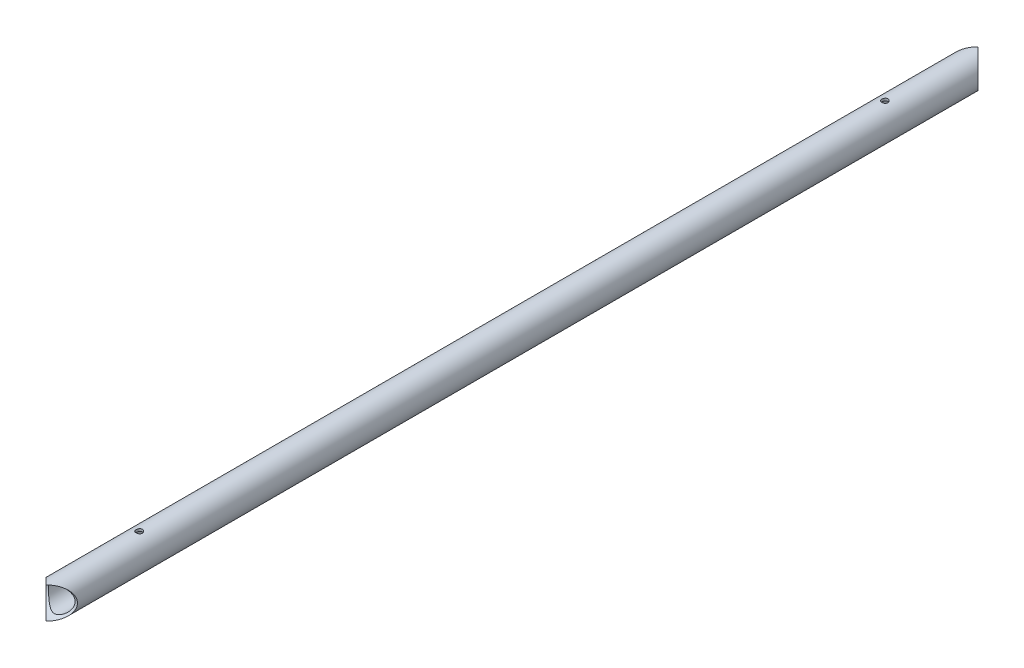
ISO-10303-21;
HEADER;
FILE_DESCRIPTION(('STEP AP214'),'2;1');
FILE_NAME('part.step','',(''),(''),'','','');
FILE_SCHEMA(('AUTOMOTIVE_DESIGN { 1 0 10303 214 1 1 1 1 }'));
ENDSEC;
DATA;
#1=APPLICATION_CONTEXT('core data for automotive mechanical design processes');
#2=APPLICATION_PROTOCOL_DEFINITION('international standard','automotive_design',2000,#1);
#3=PRODUCT_CONTEXT('',#1,'mechanical');
#4=PRODUCT('Part','Part','',(#3));
#5=PRODUCT_RELATED_PRODUCT_CATEGORY('part','',(#4));
#6=PRODUCT_DEFINITION_FORMATION('','',#4);
#7=PRODUCT_DEFINITION_CONTEXT('part definition',#1,'design');
#8=PRODUCT_DEFINITION('design','',#6,#7);
#9=PRODUCT_DEFINITION_SHAPE('','',#8);
#10=(LENGTH_UNIT() NAMED_UNIT(*) SI_UNIT(.MILLI.,.METRE.));
#11=(NAMED_UNIT(*) PLANE_ANGLE_UNIT() SI_UNIT($,.RADIAN.));
#12=(NAMED_UNIT(*) SI_UNIT($,.STERADIAN.) SOLID_ANGLE_UNIT());
#13=UNCERTAINTY_MEASURE_WITH_UNIT(LENGTH_MEASURE(1.E-05),#10,'distance_accuracy_value','');
#14=(GEOMETRIC_REPRESENTATION_CONTEXT(3) GLOBAL_UNCERTAINTY_ASSIGNED_CONTEXT((#13)) GLOBAL_UNIT_ASSIGNED_CONTEXT((#10,
#11,#12)) REPRESENTATION_CONTEXT('',''));
#15=CARTESIAN_POINT('',(0.,0.,0.));
#16=DIRECTION('',(0.,0.,1.));
#17=DIRECTION('',(1.,0.,0.));
#18=AXIS2_PLACEMENT_3D('',#15,#16,#17);
#19=CARTESIAN_POINT('',(0.,0.,714.375));
#20=DIRECTION('',(0.,0.,-1.));
#21=DIRECTION('',(-1.,0.,0.));
#22=AXIS2_PLACEMENT_3D('',#19,#20,#21);
#23=CYLINDRICAL_SURFACE('',#22,24.13);
#24=CARTESIAN_POINT('',(0.,-24.13,576.326));
#25=CARTESIAN_POINT('',(0.268214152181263,-24.1299950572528,576.325990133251));
#26=CARTESIAN_POINT('',(0.536553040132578,-24.1254821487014,576.303564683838));
#27=CARTESIAN_POINT('',(1.06564598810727,-24.1079145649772,576.214526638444));
#28=CARTESIAN_POINT('',(1.32639385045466,-24.0948531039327,576.1478789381));
#29=CARTESIAN_POINT('',(1.83257845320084,-24.06164691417,575.972537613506));
#30=CARTESIAN_POINT('',(2.07802959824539,-24.0415089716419,575.863884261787));
#31=CARTESIAN_POINT('',(2.54720135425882,-23.9963390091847,575.60773557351));
#32=CARTESIAN_POINT('',(2.77092325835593,-23.971307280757,575.46024255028));
#33=CARTESIAN_POINT('',(3.19333272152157,-23.9187256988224,575.12848362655));
#34=CARTESIAN_POINT('',(3.39168360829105,-23.8911489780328,574.943793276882));
#35=CARTESIAN_POINT('',(3.75480538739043,-23.8367809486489,574.543794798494));
#36=CARTESIAN_POINT('',(3.91957365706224,-23.8099897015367,574.328484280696));
#37=CARTESIAN_POINT('',(4.21228604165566,-23.7599636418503,573.870935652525));
#38=CARTESIAN_POINT('',(4.33988155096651,-23.7367633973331,573.628470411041));
#39=CARTESIAN_POINT('',(4.5523931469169,-23.6969276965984,573.125001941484));
#40=CARTESIAN_POINT('',(4.63731344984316,-23.6802915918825,572.864000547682));
#41=CARTESIAN_POINT('',(4.76097109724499,-23.6557395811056,572.334490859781));
#42=CARTESIAN_POINT('',(4.80029912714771,-23.6477122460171,572.066125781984));
#43=CARTESIAN_POINT('',(4.83349056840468,-23.640951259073,571.526495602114));
#44=CARTESIAN_POINT('',(4.8273586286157,-23.6422166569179,571.255230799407));
#45=CARTESIAN_POINT('',(4.77028176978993,-23.6537969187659,570.72182300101));
#46=CARTESIAN_POINT('',(4.72001399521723,-23.6639750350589,570.459604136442));
#47=CARTESIAN_POINT('',(4.57716123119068,-23.6920185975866,569.947398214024));
#48=CARTESIAN_POINT('',(4.48457422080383,-23.7098844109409,569.697411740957));
#49=CARTESIAN_POINT('',(4.25906460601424,-23.7514301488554,569.214815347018));
#50=CARTESIAN_POINT('',(4.12587360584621,-23.7751485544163,568.982334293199));
#51=CARTESIAN_POINT('',(3.82312619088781,-23.8257023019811,568.542767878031));
#52=CARTESIAN_POINT('',(3.65356559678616,-23.8525380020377,568.335685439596));
#53=CARTESIAN_POINT('',(3.2792666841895,-23.9068950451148,567.948887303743));
#54=CARTESIAN_POINT('',(3.07395043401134,-23.9344200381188,567.769730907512));
#55=CARTESIAN_POINT('',(2.63588892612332,-23.9866122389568,567.44831313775));
#56=CARTESIAN_POINT('',(2.40314331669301,-24.0112794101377,567.306052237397));
#57=CARTESIAN_POINT('',(1.91620860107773,-24.0550372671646,567.062360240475));
#58=CARTESIAN_POINT('',(1.66198666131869,-24.0741192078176,566.960993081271));
#59=CARTESIAN_POINT('',(1.13965496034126,-24.104490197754,566.80256235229));
#60=CARTESIAN_POINT('',(0.87154688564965,-24.1157801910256,566.745493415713));
#61=CARTESIAN_POINT('',(0.333859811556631,-24.129163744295,566.678070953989));
#62=CARTESIAN_POINT('',(0.0643804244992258,-24.1314079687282,566.666952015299));
#63=CARTESIAN_POINT('',(-0.472585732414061,-24.1268656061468,566.689683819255));
#64=CARTESIAN_POINT('',(-0.74007261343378,-24.1200795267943,566.723532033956));
#65=CARTESIAN_POINT('',(-1.26299151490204,-24.0983333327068,566.834601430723));
#66=CARTESIAN_POINT('',(-1.5185103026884,-24.0834472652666,566.911429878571));
#67=CARTESIAN_POINT('',(-2.01303862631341,-24.0471642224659,567.105849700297));
#68=CARTESIAN_POINT('',(-2.25204692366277,-24.0257667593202,567.223444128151));
#69=CARTESIAN_POINT('',(-2.70999770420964,-23.9784593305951,567.497713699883));
#70=CARTESIAN_POINT('',(-2.92865871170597,-23.9524973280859,567.654849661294));
#71=CARTESIAN_POINT('',(-3.33678336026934,-23.8990631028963,568.003124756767));
#72=CARTESIAN_POINT('',(-3.52624386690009,-23.8715907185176,568.194267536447));
#73=CARTESIAN_POINT('',(-3.87354349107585,-23.8177241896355,568.608614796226));
#74=CARTESIAN_POINT('',(-4.03085715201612,-23.7913528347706,568.832263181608));
#75=CARTESIAN_POINT('',(-4.30568683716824,-23.743157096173,569.303259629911));
#76=CARTESIAN_POINT('',(-4.42320445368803,-23.721332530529,569.550606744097));
#77=CARTESIAN_POINT('',(-4.61438878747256,-23.6848855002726,570.060733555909));
#78=CARTESIAN_POINT('',(-4.68828284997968,-23.670225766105,570.323425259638));
#79=CARTESIAN_POINT('',(-4.79081195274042,-23.6496892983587,570.857820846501));
#80=CARTESIAN_POINT('',(-4.81945289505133,-23.6438114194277,571.129523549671));
#81=CARTESIAN_POINT('',(-4.8304443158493,-23.6415677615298,571.668952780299));
#82=CARTESIAN_POINT('',(-4.81362511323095,-23.6450313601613,571.936662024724));
#83=CARTESIAN_POINT('',(-4.73600621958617,-23.6606991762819,572.465352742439));
#84=CARTESIAN_POINT('',(-4.67520688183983,-23.6729033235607,572.726334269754));
#85=CARTESIAN_POINT('',(-4.51172397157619,-23.7046008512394,573.233632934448));
#86=CARTESIAN_POINT('',(-4.40914221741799,-23.7240765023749,573.479984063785));
#87=CARTESIAN_POINT('',(-4.16510171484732,-23.7681327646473,573.952108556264));
#88=CARTESIAN_POINT('',(-4.0236397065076,-23.792713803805,574.177880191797));
#89=CARTESIAN_POINT('',(-3.70301834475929,-23.8447332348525,574.606571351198));
#90=CARTESIAN_POINT('',(-3.52325936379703,-23.8722130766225,574.809037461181));
#91=CARTESIAN_POINT('',(-3.13238464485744,-23.9266363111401,575.181206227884));
#92=CARTESIAN_POINT('',(-2.92126171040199,-23.9535795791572,575.350901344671));
#93=CARTESIAN_POINT('',(-2.47099707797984,-24.0042263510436,575.654387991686));
#94=CARTESIAN_POINT('',(-2.23158527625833,-24.0278929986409,575.787785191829));
#95=CARTESIAN_POINT('',(-1.7333368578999,-24.0689571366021,576.012243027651));
#96=CARTESIAN_POINT('',(-1.47451799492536,-24.0863602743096,576.103341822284));
#97=CARTESIAN_POINT('',(-1.01259850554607,-24.1095557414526,576.222974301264));
#98=CARTESIAN_POINT('',(-0.812127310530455,-24.1171774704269,576.261540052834));
#99=CARTESIAN_POINT('',(-0.407794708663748,-24.1274013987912,576.313056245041));
#100=CARTESIAN_POINT('',(-0.203933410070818,-24.1300037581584,576.326007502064));
#101=CARTESIAN_POINT('',(0.,-24.13,576.326));
#102=B_SPLINE_CURVE_WITH_KNOTS('',3,(#24,#25,#26,#27,#28,#29,#30,#31,#32,#33,#34,#35,#36,#37,
#38,#39,#40,#41,#42,#43,#44,#45,#46,#47,#48,#49,#50,#51,#52,#53,#54,#55,#56,#57,#58,#59,#60,#61,
#62,#63,#64,#65,#66,#67,#68,#69,#70,#71,#72,#73,#74,#75,#76,#77,#78,#79,#80,#81,#82,#83,#84,#85,
#86,#87,#88,#89,#90,#91,#92,#93,#94,#95,#96,#97,#98,#99,#100,#101),.UNSPECIFIED.,.T.,.F.,(4,2,2,
2,2,2,2,2,2,2,2,2,2,2,2,2,2,2,2,2,2,2,2,2,2,2,2,2,2,2,2,2,2,2,2,2,2,2,4),(0.,0.803896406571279,
1.60843172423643,2.41219760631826,3.21591562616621,4.02938506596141,4.84291800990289,
5.66385127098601,6.48470340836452,7.29479749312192,8.10480873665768,8.90260554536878,
9.70044045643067,10.503667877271,11.3069876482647,12.1247580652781,12.9425389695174,
13.7615935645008,14.5805489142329,15.3858061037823,16.1910180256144,16.9889897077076,
17.7870211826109,18.5948224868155,19.4027104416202,20.2229007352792,21.0430582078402,
21.8589027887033,22.6746409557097,23.475581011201,24.2765146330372,25.075508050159,
25.8745684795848,26.6872045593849,27.5000273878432,28.3213567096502,29.1419436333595,
29.7531960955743,30.3644290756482),.UNSPECIFIED.);
#103=CARTESIAN_POINT('',(0.,-24.13,576.326));
#104=VERTEX_POINT('',#103);
#105=EDGE_CURVE('E118',#104,#104,#102,.T.);
#106=ORIENTED_EDGE('',*,*,#105,.T.);
#107=EDGE_LOOP('',(#106));
#108=FACE_BOUND('',#107,.T.);
#109=CARTESIAN_POINT('',(0.,24.13,576.326));
#110=CARTESIAN_POINT('',(-0.26821415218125,24.1299950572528,576.325990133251));
#111=CARTESIAN_POINT('',(-0.536553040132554,24.1254821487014,576.303564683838));
#112=CARTESIAN_POINT('',(-1.0656459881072,24.1079145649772,576.214526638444));
#113=CARTESIAN_POINT('',(-1.32639385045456,24.0948531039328,576.1478789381));
#114=CARTESIAN_POINT('',(-1.83257845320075,24.06164691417,575.972537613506));
#115=CARTESIAN_POINT('',(-2.07802959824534,24.0415089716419,575.863884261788));
#116=CARTESIAN_POINT('',(-2.54720135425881,23.9963390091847,575.607735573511));
#117=CARTESIAN_POINT('',(-2.77092325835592,23.971307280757,575.46024255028));
#118=CARTESIAN_POINT('',(-3.19333272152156,23.9187256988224,575.12848362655));
#119=CARTESIAN_POINT('',(-3.39168360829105,23.8911489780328,574.943793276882));
#120=CARTESIAN_POINT('',(-3.75480538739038,23.8367809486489,574.543794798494));
#121=CARTESIAN_POINT('',(-3.91957365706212,23.8099897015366,574.328484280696));
#122=CARTESIAN_POINT('',(-4.21228604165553,23.7599636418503,573.870935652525));
#123=CARTESIAN_POINT('',(-4.33988155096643,23.7367633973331,573.628470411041));
#124=CARTESIAN_POINT('',(-4.55239314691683,23.6969276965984,573.125001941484));
#125=CARTESIAN_POINT('',(-4.63731344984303,23.6802915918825,572.864000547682));
#126=CARTESIAN_POINT('',(-4.76097109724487,23.6557395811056,572.334490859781));
#127=CARTESIAN_POINT('',(-4.80029912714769,23.6477122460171,572.066125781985));
#128=CARTESIAN_POINT('',(-4.83349056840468,23.640951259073,571.526495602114));
#129=CARTESIAN_POINT('',(-4.8273586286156,23.6422166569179,571.255230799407));
#130=CARTESIAN_POINT('',(-4.77028176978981,23.6537969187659,570.72182300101));
#131=CARTESIAN_POINT('',(-4.72001399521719,23.663975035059,570.459604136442));
#132=CARTESIAN_POINT('',(-4.5771612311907,23.6920185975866,569.947398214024));
#133=CARTESIAN_POINT('',(-4.48457422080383,23.7098844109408,569.697411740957));
#134=CARTESIAN_POINT('',(-4.25906460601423,23.7514301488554,569.214815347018));
#135=CARTESIAN_POINT('',(-4.12587360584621,23.7751485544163,568.982334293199));
#136=CARTESIAN_POINT('',(-3.82312619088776,23.8257023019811,568.542767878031));
#137=CARTESIAN_POINT('',(-3.65356559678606,23.8525380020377,568.335685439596));
#138=CARTESIAN_POINT('',(-3.27926668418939,23.9068950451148,567.948887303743));
#139=CARTESIAN_POINT('',(-3.07395043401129,23.9344200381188,567.769730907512));
#140=CARTESIAN_POINT('',(-2.63588892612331,23.9866122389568,567.44831313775));
#141=CARTESIAN_POINT('',(-2.40314331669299,24.0112794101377,567.306052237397));
#142=CARTESIAN_POINT('',(-1.91620860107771,24.0550372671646,567.062360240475));
#143=CARTESIAN_POINT('',(-1.66198666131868,24.0741192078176,566.960993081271));
#144=CARTESIAN_POINT('',(-1.13965496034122,24.104490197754,566.80256235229));
#145=CARTESIAN_POINT('',(-0.871546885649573,24.1157801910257,566.745493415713));
#146=CARTESIAN_POINT('',(-0.333859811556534,24.1291637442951,566.678070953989));
#147=CARTESIAN_POINT('',(-0.0643804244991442,24.1314079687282,566.666952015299));
#148=CARTESIAN_POINT('',(0.472585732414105,24.1268656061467,566.689683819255));
#149=CARTESIAN_POINT('',(0.740072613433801,24.1200795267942,566.723532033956));
#150=CARTESIAN_POINT('',(1.26299151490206,24.0983333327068,566.834601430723));
#151=CARTESIAN_POINT('',(1.51851030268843,24.0834472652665,566.911429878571));
#152=CARTESIAN_POINT('',(2.01303862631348,24.0471642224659,567.105849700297));
#153=CARTESIAN_POINT('',(2.25204692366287,24.0257667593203,567.223444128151));
#154=CARTESIAN_POINT('',(2.70999770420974,23.9784593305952,567.497713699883));
#155=CARTESIAN_POINT('',(2.92865871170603,23.9524973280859,567.654849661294));
#156=CARTESIAN_POINT('',(3.33678336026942,23.8990631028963,568.003124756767));
#157=CARTESIAN_POINT('',(3.52624386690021,23.8715907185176,568.194267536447));
#158=CARTESIAN_POINT('',(3.87354349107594,23.8177241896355,568.608614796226));
#159=CARTESIAN_POINT('',(4.03085715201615,23.7913528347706,568.832263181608));
#160=CARTESIAN_POINT('',(4.30568683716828,23.743157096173,569.303259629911));
#161=CARTESIAN_POINT('',(4.42320445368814,23.721332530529,569.550606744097));
#162=CARTESIAN_POINT('',(4.61438878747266,23.6848855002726,570.060733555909));
#163=CARTESIAN_POINT('',(4.68828284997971,23.670225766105,570.323425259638));
#164=CARTESIAN_POINT('',(4.79081195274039,23.6496892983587,570.857820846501));
#165=CARTESIAN_POINT('',(4.81945289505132,23.6438114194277,571.129523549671));
#166=CARTESIAN_POINT('',(4.8304443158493,23.6415677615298,571.668952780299));
#167=CARTESIAN_POINT('',(4.81362511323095,23.6450313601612,571.936662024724));
#168=CARTESIAN_POINT('',(4.73600621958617,23.6606991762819,572.465352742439));
#169=CARTESIAN_POINT('',(4.67520688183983,23.6729033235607,572.726334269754));
#170=CARTESIAN_POINT('',(4.51172397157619,23.7046008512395,573.233632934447));
#171=CARTESIAN_POINT('',(4.40914221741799,23.7240765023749,573.479984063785));
#172=CARTESIAN_POINT('',(4.16510171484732,23.7681327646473,573.952108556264));
#173=CARTESIAN_POINT('',(4.0236397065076,23.7927138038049,574.177880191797));
#174=CARTESIAN_POINT('',(3.70301834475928,23.8447332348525,574.606571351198));
#175=CARTESIAN_POINT('',(3.523259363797,23.8722130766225,574.809037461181));
#176=CARTESIAN_POINT('',(3.13238464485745,23.9266363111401,575.181206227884));
#177=CARTESIAN_POINT('',(2.92126171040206,23.9535795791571,575.350901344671));
#178=CARTESIAN_POINT('',(2.47099707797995,24.0042263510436,575.654387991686));
#179=CARTESIAN_POINT('',(2.23158527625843,24.0278929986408,575.787785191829));
#180=CARTESIAN_POINT('',(1.73333685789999,24.0689571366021,576.012243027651));
#181=CARTESIAN_POINT('',(1.47451799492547,24.0863602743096,576.103341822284));
#182=CARTESIAN_POINT('',(1.01259850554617,24.1095557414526,576.222974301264));
#183=CARTESIAN_POINT('',(0.812127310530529,24.1171774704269,576.261540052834));
#184=CARTESIAN_POINT('',(0.407794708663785,24.1274013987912,576.313056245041));
#185=CARTESIAN_POINT('',(0.203933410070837,24.1300037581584,576.326007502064));
#186=CARTESIAN_POINT('',(0.,24.13,576.326));
#187=B_SPLINE_CURVE_WITH_KNOTS('',3,(#109,#110,#111,#112,#113,#114,#115,#116,#117,#118,#119,
#120,#121,#122,#123,#124,#125,#126,#127,#128,#129,#130,#131,#132,#133,#134,#135,#136,#137,#138,
#139,#140,#141,#142,#143,#144,#145,#146,#147,#148,#149,#150,#151,#152,#153,#154,#155,#156,#157,
#158,#159,#160,#161,#162,#163,#164,#165,#166,#167,#168,#169,#170,#171,#172,#173,#174,#175,#176,
#177,#178,#179,#180,#181,#182,#183,#184,#185,#186),.UNSPECIFIED.,.T.,.F.,(4,2,2,2,2,2,2,2,2,2,2,
2,2,2,2,2,2,2,2,2,2,2,2,2,2,2,2,2,2,2,2,2,2,2,2,2,2,2,4),(0.,0.803896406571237,1.60843172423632,
2.41219760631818,3.21591562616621,4.0293850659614,4.84291800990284,5.66385127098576,
6.48470340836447,7.29479749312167,8.10480873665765,8.90260554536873,9.70044045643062,
10.503667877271,11.3069876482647,12.1247580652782,12.9425389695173,13.7615935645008,
14.5805489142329,15.3858061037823,16.1910180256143,16.9889897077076,17.787021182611,
18.5948224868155,19.4027104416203,20.2229007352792,21.0430582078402,21.8589027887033,
22.6746409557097,23.475581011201,24.2765146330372,25.075508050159,25.8745684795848,
26.687204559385,27.5000273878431,28.3213567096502,29.1419436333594,29.7531960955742,
30.3644290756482),.UNSPECIFIED.);
#188=CARTESIAN_POINT('',(0.,24.13,576.326));
#189=VERTEX_POINT('',#188);
#190=EDGE_CURVE('E144',#189,#189,#187,.T.);
#191=ORIENTED_EDGE('',*,*,#190,.T.);
#192=EDGE_LOOP('',(#191));
#193=FACE_BOUND('',#192,.T.);
#194=CARTESIAN_POINT('',(4.44089209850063E-13,-24.13,-566.674));
#195=CARTESIAN_POINT('',(0.2682141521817,-24.1299950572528,-566.674009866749));
#196=CARTESIAN_POINT('',(0.536553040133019,-24.1254821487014,-566.696435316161));
#197=CARTESIAN_POINT('',(1.06564598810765,-24.1079145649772,-566.785473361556));
#198=CARTESIAN_POINT('',(1.32639385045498,-24.0948531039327,-566.8521210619));
#199=CARTESIAN_POINT('',(1.83257845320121,-24.06164691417,-567.027462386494));
#200=CARTESIAN_POINT('',(2.07802959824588,-24.0415089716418,-567.136115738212));
#201=CARTESIAN_POINT('',(2.54720135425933,-23.9963390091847,-567.392264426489));
#202=CARTESIAN_POINT('',(2.77092325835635,-23.9713072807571,-567.53975744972));
#203=CARTESIAN_POINT('',(3.19333272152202,-23.9187256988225,-567.871516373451));
#204=CARTESIAN_POINT('',(3.39168360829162,-23.8911489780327,-568.056206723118));
#205=CARTESIAN_POINT('',(3.75480538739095,-23.8367809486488,-568.456205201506));
#206=CARTESIAN_POINT('',(3.9195736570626,-23.8099897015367,-568.671515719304));
#207=CARTESIAN_POINT('',(4.21228604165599,-23.7599636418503,-569.129064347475));
#208=CARTESIAN_POINT('',(4.33988155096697,-23.736763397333,-569.371529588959));
#209=CARTESIAN_POINT('',(4.55239314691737,-23.6969276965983,-569.874998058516));
#210=CARTESIAN_POINT('',(4.6373134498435,-23.6802915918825,-570.135999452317));
#211=CARTESIAN_POINT('',(4.76097109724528,-23.6557395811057,-570.665509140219));
#212=CARTESIAN_POINT('',(4.80029912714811,-23.647712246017,-570.933874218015));
#213=CARTESIAN_POINT('',(4.83349056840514,-23.6409512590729,-571.473504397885));
#214=CARTESIAN_POINT('',(4.82735862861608,-23.6422166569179,-571.744769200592));
#215=CARTESIAN_POINT('',(4.77028176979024,-23.6537969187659,-572.27817699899));
#216=CARTESIAN_POINT('',(4.7200139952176,-23.6639750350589,-572.540395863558));
#217=CARTESIAN_POINT('',(4.57716123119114,-23.6920185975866,-573.052601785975));
#218=CARTESIAN_POINT('',(4.4845742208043,-23.7098844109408,-573.302588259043));
#219=CARTESIAN_POINT('',(4.25906460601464,-23.7514301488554,-573.785184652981));
#220=CARTESIAN_POINT('',(4.12587360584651,-23.7751485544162,-574.017665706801));
#221=CARTESIAN_POINT('',(3.82312619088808,-23.825702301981,-574.457232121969));
#222=CARTESIAN_POINT('',(3.6535655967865,-23.8525380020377,-574.664314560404));
#223=CARTESIAN_POINT('',(3.27926668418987,-23.9068950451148,-575.051112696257));
#224=CARTESIAN_POINT('',(3.07395043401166,-23.9344200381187,-575.230269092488));
#225=CARTESIAN_POINT('',(2.63588892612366,-23.9866122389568,-575.551686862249));
#226=CARTESIAN_POINT('',(2.4031433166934,-24.0112794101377,-575.693947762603));
#227=CARTESIAN_POINT('',(1.91620860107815,-24.0550372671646,-575.937639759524));
#228=CARTESIAN_POINT('',(1.66198666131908,-24.0741192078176,-576.039006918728));
#229=CARTESIAN_POINT('',(1.13965496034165,-24.104490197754,-576.19743764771));
#230=CARTESIAN_POINT('',(0.871546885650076,-24.1157801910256,-576.254506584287));
#231=CARTESIAN_POINT('',(0.333859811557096,-24.129163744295,-576.321929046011));
#232=CARTESIAN_POINT('',(0.0643804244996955,-24.1314079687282,-576.333047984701));
#233=CARTESIAN_POINT('',(-0.472585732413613,-24.1268656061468,-576.310316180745));
#234=CARTESIAN_POINT('',(-0.740072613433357,-24.1200795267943,-576.276467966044));
#235=CARTESIAN_POINT('',(-1.26299151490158,-24.0983333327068,-576.165398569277));
#236=CARTESIAN_POINT('',(-1.51851030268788,-24.0834472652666,-576.088570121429));
#237=CARTESIAN_POINT('',(-2.01303862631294,-24.0471642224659,-575.894150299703));
#238=CARTESIAN_POINT('',(-2.25204692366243,-24.0257667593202,-575.776555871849));
#239=CARTESIAN_POINT('',(-2.70999770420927,-23.9784593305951,-575.502286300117));
#240=CARTESIAN_POINT('',(-2.92865871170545,-23.952497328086,-575.345150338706));
#241=CARTESIAN_POINT('',(-3.33678336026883,-23.8990631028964,-574.996875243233));
#242=CARTESIAN_POINT('',(-3.52624386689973,-23.8715907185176,-574.805732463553));
#243=CARTESIAN_POINT('',(-3.8735434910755,-23.8177241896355,-574.391385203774));
#244=CARTESIAN_POINT('',(-4.03085715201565,-23.7913528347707,-574.167736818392));
#245=CARTESIAN_POINT('',(-4.30568683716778,-23.7431570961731,-573.696740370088));
#246=CARTESIAN_POINT('',(-4.4232044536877,-23.721332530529,-573.449393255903));
#247=CARTESIAN_POINT('',(-4.61438878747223,-23.6848855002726,-572.939266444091));
#248=CARTESIAN_POINT('',(-4.68828284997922,-23.6702257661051,-572.676574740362));
#249=CARTESIAN_POINT('',(-4.79081195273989,-23.6496892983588,-572.142179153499));
#250=CARTESIAN_POINT('',(-4.81945289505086,-23.6438114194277,-571.870476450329));
#251=CARTESIAN_POINT('',(-4.83044431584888,-23.6415677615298,-571.331047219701));
#252=CARTESIAN_POINT('',(-4.81362511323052,-23.6450313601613,-571.063337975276));
#253=CARTESIAN_POINT('',(-4.73600621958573,-23.6606991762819,-570.534647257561));
#254=CARTESIAN_POINT('',(-4.67520688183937,-23.6729033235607,-570.273665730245));
#255=CARTESIAN_POINT('',(-4.51172397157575,-23.7046008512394,-569.766367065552));
#256=CARTESIAN_POINT('',(-4.40914221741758,-23.724076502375,-569.520015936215));
#257=CARTESIAN_POINT('',(-4.16510171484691,-23.7681327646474,-569.047891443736));
#258=CARTESIAN_POINT('',(-4.02363970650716,-23.792713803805,-568.822119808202));
#259=CARTESIAN_POINT('',(-3.70301834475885,-23.8447332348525,-568.393428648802));
#260=CARTESIAN_POINT('',(-3.52325936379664,-23.8722130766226,-568.190962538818));
#261=CARTESIAN_POINT('',(-3.13238464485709,-23.9266363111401,-567.818793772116));
#262=CARTESIAN_POINT('',(-2.92126171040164,-23.9535795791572,-567.649098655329));
#263=CARTESIAN_POINT('',(-2.47099707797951,-24.0042263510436,-567.345612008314));
#264=CARTESIAN_POINT('',(-2.23158527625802,-24.0278929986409,-567.21221480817));
#265=CARTESIAN_POINT('',(-1.73333685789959,-24.0689571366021,-566.987756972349));
#266=CARTESIAN_POINT('',(-1.47451799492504,-24.0863602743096,-566.896658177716));
#267=CARTESIAN_POINT('',(-1.01259850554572,-24.1095557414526,-566.777025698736));
#268=CARTESIAN_POINT('',(-0.812127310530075,-24.1171774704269,-566.738459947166));
#269=CARTESIAN_POINT('',(-0.407794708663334,-24.1274013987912,-566.686943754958));
#270=CARTESIAN_POINT('',(-0.203933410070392,-24.1300037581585,-566.673992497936));
#271=CARTESIAN_POINT('',(4.44089209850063E-13,-24.13,-566.674));
#272=B_SPLINE_CURVE_WITH_KNOTS('',3,(#194,#195,#196,#197,#198,#199,#200,#201,#202,#203,#204,
#205,#206,#207,#208,#209,#210,#211,#212,#213,#214,#215,#216,#217,#218,#219,#220,#221,#222,#223,
#224,#225,#226,#227,#228,#229,#230,#231,#232,#233,#234,#235,#236,#237,#238,#239,#240,#241,#242,
#243,#244,#245,#246,#247,#248,#249,#250,#251,#252,#253,#254,#255,#256,#257,#258,#259,#260,#261,
#262,#263,#264,#265,#266,#267,#268,#269,#270,#271),.UNSPECIFIED.,.T.,.F.,(4,2,2,2,2,2,2,2,2,2,2,
2,2,2,2,2,2,2,2,2,2,2,2,2,2,2,2,2,2,2,2,2,2,2,2,2,2,2,4),(0.,0.803896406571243,1.60843172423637,
2.41219760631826,3.21591562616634,4.02938506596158,4.84291800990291,5.663851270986,
6.48470340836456,7.29479749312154,8.10480873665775,8.9026055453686,9.7004404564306,
10.5036678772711,11.3069876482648,12.1247580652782,12.9425389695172,13.7615935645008,
14.5805489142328,15.3858061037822,16.1910180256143,16.9889897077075,17.7870211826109,
18.5948224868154,19.4027104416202,20.2229007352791,21.0430582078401,21.8589027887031,
22.6746409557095,23.475581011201,24.2765146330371,25.0755080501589,25.8745684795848,
26.6872045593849,27.5000273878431,28.3213567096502,29.1419436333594,29.7531960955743,
30.3644290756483),.UNSPECIFIED.);
#273=CARTESIAN_POINT('',(4.44089209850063E-13,-24.13,-566.674));
#274=VERTEX_POINT('',#273);
#275=EDGE_CURVE('E117',#274,#274,#272,.T.);
#276=ORIENTED_EDGE('',*,*,#275,.T.);
#277=EDGE_LOOP('',(#276));
#278=FACE_BOUND('',#277,.T.);
#279=CARTESIAN_POINT('',(4.44089209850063E-13,24.13,-566.674));
#280=CARTESIAN_POINT('',(-0.268214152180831,24.1299950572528,-566.674009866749));
#281=CARTESIAN_POINT('',(-0.536553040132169,24.1254821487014,-566.696435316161));
#282=CARTESIAN_POINT('',(-1.06564598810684,24.1079145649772,-566.785473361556));
#283=CARTESIAN_POINT('',(-1.32639385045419,24.0948531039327,-566.8521210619));
#284=CARTESIAN_POINT('',(-1.8325784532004,24.06164691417,-567.027462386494));
#285=CARTESIAN_POINT('',(-2.07802959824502,24.041508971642,-567.136115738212));
#286=CARTESIAN_POINT('',(-2.54720135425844,23.9963390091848,-567.392264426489));
#287=CARTESIAN_POINT('',(-2.77092325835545,23.971307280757,-567.53975744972));
#288=CARTESIAN_POINT('',(-3.19333272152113,23.9187256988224,-567.871516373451));
#289=CARTESIAN_POINT('',(-3.39168360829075,23.8911489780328,-568.056206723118));
#290=CARTESIAN_POINT('',(-3.75480538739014,23.836780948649,-568.456205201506));
#291=CARTESIAN_POINT('',(-3.91957365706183,23.8099897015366,-568.671515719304));
#292=CARTESIAN_POINT('',(-4.21228604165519,23.7599636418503,-569.129064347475));
#293=CARTESIAN_POINT('',(-4.3398815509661,23.7367633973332,-569.371529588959));
#294=CARTESIAN_POINT('',(-4.55239314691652,23.6969276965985,-569.874998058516));
#295=CARTESIAN_POINT('',(-4.63731344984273,23.6802915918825,-570.135999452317));
#296=CARTESIAN_POINT('',(-4.76097109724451,23.6557395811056,-570.665509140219));
#297=CARTESIAN_POINT('',(-4.80029912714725,23.6477122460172,-570.933874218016));
#298=CARTESIAN_POINT('',(-4.83349056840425,23.6409512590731,-571.473504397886));
#299=CARTESIAN_POINT('',(-4.82735862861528,23.6422166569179,-571.744769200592));
#300=CARTESIAN_POINT('',(-4.77028176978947,23.6537969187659,-572.27817699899));
#301=CARTESIAN_POINT('',(-4.72001399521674,23.663975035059,-572.540395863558));
#302=CARTESIAN_POINT('',(-4.5771612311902,23.6920185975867,-573.052601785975));
#303=CARTESIAN_POINT('',(-4.48457422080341,23.7098844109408,-573.302588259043));
#304=CARTESIAN_POINT('',(-4.25906460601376,23.7514301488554,-573.785184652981));
#305=CARTESIAN_POINT('',(-4.12587360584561,23.7751485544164,-574.017665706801));
#306=CARTESIAN_POINT('',(-3.82312619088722,23.8257023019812,-574.457232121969));
#307=CARTESIAN_POINT('',(-3.65356559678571,23.8525380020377,-574.664314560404));
#308=CARTESIAN_POINT('',(-3.2792666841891,23.9068950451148,-575.051112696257));
#309=CARTESIAN_POINT('',(-3.07395043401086,23.9344200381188,-575.230269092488));
#310=CARTESIAN_POINT('',(-2.6358889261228,23.9866122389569,-575.551686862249));
#311=CARTESIAN_POINT('',(-2.40314331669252,24.0112794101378,-575.693947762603));
#312=CARTESIAN_POINT('',(-1.91620860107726,24.0550372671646,-575.937639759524));
#313=CARTESIAN_POINT('',(-1.66198666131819,24.0741192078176,-576.039006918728));
#314=CARTESIAN_POINT('',(-1.13965496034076,24.104490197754,-576.19743764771));
#315=CARTESIAN_POINT('',(-0.871546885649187,24.1157801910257,-576.254506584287));
#316=CARTESIAN_POINT('',(-0.333859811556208,24.1291637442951,-576.321929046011));
#317=CARTESIAN_POINT('',(-0.0643804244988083,24.1314079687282,-576.333047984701));
#318=CARTESIAN_POINT('',(0.4725857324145,24.1268656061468,-576.310316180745));
#319=CARTESIAN_POINT('',(0.740072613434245,24.1200795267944,-576.276467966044));
#320=CARTESIAN_POINT('',(1.26299151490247,24.0983333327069,-576.165398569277));
#321=CARTESIAN_POINT('',(1.51851030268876,24.0834472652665,-576.088570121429));
#322=CARTESIAN_POINT('',(2.01303862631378,24.0471642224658,-575.894150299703));
#323=CARTESIAN_POINT('',(2.25204692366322,24.0257667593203,-575.776555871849));
#324=CARTESIAN_POINT('',(2.7099977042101,23.9784593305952,-575.502286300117));
#325=CARTESIAN_POINT('',(2.92865871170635,23.9524973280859,-575.345150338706));
#326=CARTESIAN_POINT('',(3.33678336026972,23.8990631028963,-574.996875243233));
#327=CARTESIAN_POINT('',(3.52624386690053,23.8715907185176,-574.805732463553));
#328=CARTESIAN_POINT('',(3.87354349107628,23.8177241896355,-574.391385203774));
#329=CARTESIAN_POINT('',(4.0308571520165,23.7913528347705,-574.167736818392));
#330=CARTESIAN_POINT('',(4.30568683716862,23.7431570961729,-573.696740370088));
#331=CARTESIAN_POINT('',(4.42320445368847,23.721332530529,-573.449393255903));
#332=CARTESIAN_POINT('',(4.61438878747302,23.6848855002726,-572.939266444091));
#333=CARTESIAN_POINT('',(4.68828284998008,23.6702257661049,-572.676574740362));
#334=CARTESIAN_POINT('',(4.7908119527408,23.6496892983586,-572.142179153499));
#335=CARTESIAN_POINT('',(4.81945289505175,23.6438114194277,-571.870476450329));
#336=CARTESIAN_POINT('',(4.83044431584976,23.6415677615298,-571.331047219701));
#337=CARTESIAN_POINT('',(4.81362511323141,23.6450313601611,-571.063337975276));
#338=CARTESIAN_POINT('',(4.73600621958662,23.6606991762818,-570.534647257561));
#339=CARTESIAN_POINT('',(4.67520688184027,23.6729033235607,-570.273665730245));
#340=CARTESIAN_POINT('',(4.51172397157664,23.7046008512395,-569.766367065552));
#341=CARTESIAN_POINT('',(4.40914221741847,23.7240765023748,-569.520015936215));
#342=CARTESIAN_POINT('',(4.16510171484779,23.7681327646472,-569.047891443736));
#343=CARTESIAN_POINT('',(4.02363970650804,23.7927138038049,-568.822119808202));
#344=CARTESIAN_POINT('',(3.70301834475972,23.8447332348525,-568.393428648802));
#345=CARTESIAN_POINT('',(3.52325936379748,23.8722130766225,-568.190962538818));
#346=CARTESIAN_POINT('',(3.13238464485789,23.92663631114,-567.818793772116));
#347=CARTESIAN_POINT('',(2.92126171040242,23.9535795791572,-567.649098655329));
#348=CARTESIAN_POINT('',(2.47099707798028,24.0042263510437,-567.345612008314));
#349=CARTESIAN_POINT('',(2.2315852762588,24.0278929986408,-567.21221480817));
#350=CARTESIAN_POINT('',(1.73333685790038,24.068957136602,-566.987756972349));
#351=CARTESIAN_POINT('',(1.47451799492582,24.0863602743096,-566.896658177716));
#352=CARTESIAN_POINT('',(1.01259850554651,24.1095557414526,-566.777025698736));
#353=CARTESIAN_POINT('',(0.812127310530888,24.1171774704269,-566.738459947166));
#354=CARTESIAN_POINT('',(0.407794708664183,24.1274013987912,-566.686943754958));
#355=CARTESIAN_POINT('',(0.203933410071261,24.1300037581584,-566.673992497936));
#356=CARTESIAN_POINT('',(4.44089209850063E-13,24.13,-566.674));
#357=B_SPLINE_CURVE_WITH_KNOTS('',3,(#279,#280,#281,#282,#283,#284,#285,#286,#287,#288,#289,
#290,#291,#292,#293,#294,#295,#296,#297,#298,#299,#300,#301,#302,#303,#304,#305,#306,#307,#308,
#309,#310,#311,#312,#313,#314,#315,#316,#317,#318,#319,#320,#321,#322,#323,#324,#325,#326,#327,
#328,#329,#330,#331,#332,#333,#334,#335,#336,#337,#338,#339,#340,#341,#342,#343,#344,#345,#346,
#347,#348,#349,#350,#351,#352,#353,#354,#355,#356),.UNSPECIFIED.,.T.,.F.,(4,2,2,2,2,2,2,2,2,2,2,
2,2,2,2,2,2,2,2,2,2,2,2,2,2,2,2,2,2,2,2,2,2,2,2,2,2,2,4),(0.,0.803896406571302,1.60843172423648,
2.41219760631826,3.21591562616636,4.0293850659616,4.842918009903,5.66385127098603,
6.48470340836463,7.29479749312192,8.10480873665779,8.90260554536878,9.70044045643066,
10.5036678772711,11.3069876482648,12.1247580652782,12.9425389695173,13.7615935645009,
14.5805489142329,15.3858061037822,16.1910180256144,16.9889897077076,17.7870211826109,
18.5948224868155,19.4027104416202,20.2229007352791,21.0430582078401,21.8589027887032,
22.6746409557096,23.475581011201,24.2765146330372,25.0755080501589,25.8745684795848,
26.687204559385,27.5000273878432,28.3213567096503,29.1419436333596,29.7531960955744,
30.3644290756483),.UNSPECIFIED.);
#358=CARTESIAN_POINT('',(4.44089209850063E-13,24.13,-566.674));
#359=VERTEX_POINT('',#358);
#360=EDGE_CURVE('E112',#359,#359,#357,.T.);
#361=ORIENTED_EDGE('',*,*,#360,.T.);
#362=EDGE_LOOP('',(#361));
#363=FACE_BOUND('',#362,.T.);
#364=CARTESIAN_POINT('',(0.,0.,714.375));
#365=DIRECTION('',(-0.707106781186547,0.,-0.707106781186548));
#366=DIRECTION('',(0.707106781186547,0.,-0.707106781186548));
#367=AXIS2_PLACEMENT_3D('',#364,#365,#366);
#368=ELLIPSE('',#367,34.1249732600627,24.13);
#369=CARTESIAN_POINT('',(0.,24.13,714.375));
#370=VERTEX_POINT('',#369);
#371=CARTESIAN_POINT('',(0.,-24.13,714.375));
#372=VERTEX_POINT('',#371);
#373=EDGE_CURVE('E47',#370,#372,#368,.T.);
#374=ORIENTED_EDGE('',*,*,#373,.T.);
#375=CARTESIAN_POINT('',(0.,0.,714.375));
#376=DIRECTION('',(0.707106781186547,0.,-0.707106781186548));
#377=DIRECTION('',(-0.707106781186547,0.,-0.707106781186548));
#378=AXIS2_PLACEMENT_3D('',#375,#376,#377);
#379=ELLIPSE('',#378,34.1249732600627,24.13);
#380=EDGE_CURVE('E11',#372,#370,#379,.T.);
#381=ORIENTED_EDGE('',*,*,#380,.T.);
#382=EDGE_LOOP('',(#374,#381));
#383=FACE_BOUND('',#382,.T.);
#384=CARTESIAN_POINT('',(4.44089209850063E-13,0.,-714.375));
#385=DIRECTION('',(-0.707106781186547,0.,-0.707106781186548));
#386=DIRECTION('',(0.707106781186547,0.,-0.707106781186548));
#387=AXIS2_PLACEMENT_3D('',#384,#385,#386);
#388=ELLIPSE('',#387,34.1249732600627,24.13);
#389=CARTESIAN_POINT('',(4.44089209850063E-13,24.13,-714.375));
#390=VERTEX_POINT('',#389);
#391=CARTESIAN_POINT('',(3.33066907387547E-13,-24.13,-714.375));
#392=VERTEX_POINT('',#391);
#393=EDGE_CURVE('E64',#390,#392,#388,.F.);
#394=ORIENTED_EDGE('',*,*,#393,.T.);
#395=CARTESIAN_POINT('',(4.44089209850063E-13,0.,-714.375));
#396=DIRECTION('',(0.707106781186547,0.,-0.707106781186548));
#397=DIRECTION('',(-0.707106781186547,0.,-0.707106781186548));
#398=AXIS2_PLACEMENT_3D('',#395,#396,#397);
#399=ELLIPSE('',#398,34.1249732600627,24.13);
#400=EDGE_CURVE('E54',#392,#390,#399,.F.);
#401=ORIENTED_EDGE('',*,*,#400,.T.);
#402=EDGE_LOOP('',(#394,#401));
#403=FACE_BOUND('',#402,.T.);
#404=ADVANCED_FACE('F35',(#108,#193,#278,#363,#383,#403),#23,.T.);
#405=CARTESIAN_POINT('',(0.,0.,714.375));
#406=DIRECTION('',(0.,0.,-1.));
#407=DIRECTION('',(-1.,0.,0.));
#408=AXIS2_PLACEMENT_3D('',#405,#406,#407);
#409=CYLINDRICAL_SURFACE('',#408,20.447);
#410=CARTESIAN_POINT('',(0.,-20.447,576.326));
#411=CARTESIAN_POINT('',(0.267112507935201,-20.4469952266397,576.32599169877));
#412=CARTESIAN_POINT('',(0.534321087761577,-20.4417131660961,576.303748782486));
#413=CARTESIAN_POINT('',(1.061111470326,-20.4211529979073,576.215479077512));
#414=CARTESIAN_POINT('',(1.32068832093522,-20.4058685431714,576.149424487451));
#415=CARTESIAN_POINT('',(1.82452913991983,-20.3670004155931,575.975744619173));
#416=CARTESIAN_POINT('',(2.06881004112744,-20.3434261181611,575.868166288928));
#417=CARTESIAN_POINT('',(2.53585307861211,-20.2905044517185,575.614650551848));
#418=CARTESIAN_POINT('',(2.75861507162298,-20.2611570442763,575.468712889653));
#419=CARTESIAN_POINT('',(3.18042297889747,-20.1992813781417,575.139765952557));
#420=CARTESIAN_POINT('',(3.37901378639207,-20.1667084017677,574.956181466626));
#421=CARTESIAN_POINT('',(3.74289076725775,-20.1023580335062,574.558385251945));
#422=CARTESIAN_POINT('',(3.90817356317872,-20.0705807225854,574.344170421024));
#423=CARTESIAN_POINT('',(4.20282167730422,-20.0109736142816,573.887738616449));
#424=CARTESIAN_POINT('',(4.33168928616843,-19.9832008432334,573.645192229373));
#425=CARTESIAN_POINT('',(4.54665209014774,-19.9353949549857,573.141119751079));
#426=CARTESIAN_POINT('',(4.6327533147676,-19.9153607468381,572.879596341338));
#427=CARTESIAN_POINT('',(4.75820900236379,-19.8857581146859,572.349967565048));
#428=CARTESIAN_POINT('',(4.79837609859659,-19.8760080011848,572.082065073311));
#429=CARTESIAN_POINT('',(4.83335257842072,-19.8675328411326,571.543160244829));
#430=CARTESIAN_POINT('',(4.8281684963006,-19.8688062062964,571.272158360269));
#431=CARTESIAN_POINT('',(4.77324071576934,-19.8820702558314,570.740887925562));
#432=CARTESIAN_POINT('',(4.72445393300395,-19.893830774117,570.480513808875));
#433=CARTESIAN_POINT('',(4.58522728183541,-19.9263785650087,569.971753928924));
#434=CARTESIAN_POINT('',(4.49478473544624,-19.9471664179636,569.723368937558));
#435=CARTESIAN_POINT('',(4.27396949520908,-19.9956450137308,569.243014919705));
#436=CARTESIAN_POINT('',(4.14324002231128,-20.023397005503,569.01121634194));
#437=CARTESIAN_POINT('',(3.84581196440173,-20.0826409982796,568.572497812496));
#438=CARTESIAN_POINT('',(3.67910772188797,-20.1141335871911,568.365581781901));
#439=CARTESIAN_POINT('',(3.30945516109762,-20.1782880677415,567.977006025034));
#440=CARTESIAN_POINT('',(3.10569638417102,-20.2109593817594,567.796117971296));
#441=CARTESIAN_POINT('',(2.67035329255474,-20.2730681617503,567.470942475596));
#442=CARTESIAN_POINT('',(2.43876829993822,-20.302505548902,567.326655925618));
#443=CARTESIAN_POINT('',(1.95331941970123,-20.354951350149,567.078539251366));
#444=CARTESIAN_POINT('',(1.69939512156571,-20.3779415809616,566.974823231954));
#445=CARTESIAN_POINT('',(1.17705554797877,-20.4147693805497,566.811755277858));
#446=CARTESIAN_POINT('',(0.908642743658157,-20.4286085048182,566.752395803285));
#447=CARTESIAN_POINT('',(0.371552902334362,-20.4453486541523,566.680878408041));
#448=CARTESIAN_POINT('',(0.103023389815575,-20.4484934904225,566.667668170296));
#449=CARTESIAN_POINT('',(-0.432407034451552,-20.4441799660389,566.685953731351));
#450=CARTESIAN_POINT('',(-0.699308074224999,-20.4367224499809,566.717445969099));
#451=CARTESIAN_POINT('',(-1.22032705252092,-20.4121973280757,566.823372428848));
#452=CARTESIAN_POINT('',(-1.47456610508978,-20.3952559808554,566.897242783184));
#453=CARTESIAN_POINT('',(-1.96703795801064,-20.353665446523,567.085192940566));
#454=CARTESIAN_POINT('',(-2.20526924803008,-20.3290155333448,567.199276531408));
#455=CARTESIAN_POINT('',(-2.66322640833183,-20.274149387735,567.466524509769));
#456=CARTESIAN_POINT('',(-2.88259028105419,-20.2438495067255,567.620291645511));
#457=CARTESIAN_POINT('',(-3.29277682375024,-20.1811931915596,567.961760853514));
#458=CARTESIAN_POINT('',(-3.48359512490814,-20.1488364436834,568.149468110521));
#459=CARTESIAN_POINT('',(-3.83553022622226,-20.0848516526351,568.558350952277));
#460=CARTESIAN_POINT('',(-3.99591291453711,-20.0532546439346,568.78016423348));
#461=CARTESIAN_POINT('',(-4.27716505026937,-19.9951587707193,569.24818765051));
#462=CARTESIAN_POINT('',(-4.39803626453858,-19.9686596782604,569.494396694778));
#463=CARTESIAN_POINT('',(-4.59596305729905,-19.9240365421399,570.002878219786));
#464=CARTESIAN_POINT('',(-4.67327575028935,-19.9058634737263,570.265046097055));
#465=CARTESIAN_POINT('',(-4.78260858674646,-19.8798813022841,570.799145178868));
#466=CARTESIAN_POINT('',(-4.81463737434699,-19.8720702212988,571.071074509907));
#467=CARTESIAN_POINT('',(-4.8320794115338,-19.8678353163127,571.609540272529));
#468=CARTESIAN_POINT('',(-4.81866136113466,-19.8711259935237,571.876037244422));
#469=CARTESIAN_POINT('',(-4.7482366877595,-19.8880703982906,572.402855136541));
#470=CARTESIAN_POINT('',(-4.69123076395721,-19.90172395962,572.663176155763));
#471=CARTESIAN_POINT('',(-4.53585381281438,-19.9377055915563,573.169140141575));
#472=CARTESIAN_POINT('',(-4.43767935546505,-19.9599924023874,573.414846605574));
#473=CARTESIAN_POINT('',(-4.20291217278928,-20.0107395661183,573.886465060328));
#474=CARTESIAN_POINT('',(-4.06631471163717,-20.0392006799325,574.11237460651));
#475=CARTESIAN_POINT('',(-3.75481727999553,-20.0999216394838,574.543687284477));
#476=CARTESIAN_POINT('',(-3.57909605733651,-20.1322547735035,574.748487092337));
#477=CARTESIAN_POINT('',(-3.19596964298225,-20.1966147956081,575.126073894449));
#478=CARTESIAN_POINT('',(-2.98855704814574,-20.2286416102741,575.298853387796));
#479=CARTESIAN_POINT('',(-2.54401702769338,-20.2893774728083,575.610112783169));
#480=CARTESIAN_POINT('',(-2.30647517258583,-20.3180267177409,575.748013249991));
#481=CARTESIAN_POINT('',(-1.81093948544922,-20.3681642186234,575.981706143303));
#482=CARTESIAN_POINT('',(-1.55296166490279,-20.3896580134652,576.077531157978));
#483=CARTESIAN_POINT('',(-1.07924422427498,-20.4195775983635,576.208793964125));
#484=CARTESIAN_POINT('',(-0.865912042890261,-20.4297936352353,576.252656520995));
#485=CARTESIAN_POINT('',(-0.435074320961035,-20.4435065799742,576.311262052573));
#486=CARTESIAN_POINT('',(-0.217569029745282,-20.4470038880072,576.326006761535));
#487=CARTESIAN_POINT('',(0.,-20.447,576.326));
#488=B_SPLINE_CURVE_WITH_KNOTS('',3,(#410,#411,#412,#413,#414,#415,#416,#417,#418,#419,#420,
#421,#422,#423,#424,#425,#426,#427,#428,#429,#430,#431,#432,#433,#434,#435,#436,#437,#438,#439,
#440,#441,#442,#443,#444,#445,#446,#447,#448,#449,#450,#451,#452,#453,#454,#455,#456,#457,#458,
#459,#460,#461,#462,#463,#464,#465,#466,#467,#468,#469,#470,#471,#472,#473,#474,#475,#476,#477,
#478,#479,#480,#481,#482,#483,#484,#485,#486,#487),.UNSPECIFIED.,.T.,.F.,(4,2,2,2,2,2,2,2,2,2,2,
2,2,2,2,2,2,2,2,2,2,2,2,2,2,2,2,2,2,2,2,2,2,2,2,2,2,2,4),(0.,0.800540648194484,1.60158977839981,
2.40173585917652,3.20188726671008,4.01532210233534,4.82883937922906,5.65299000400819,
6.47702440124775,7.28624339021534,8.0953457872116,8.88711594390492,9.67893700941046,
10.4779823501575,11.2771534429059,12.0965490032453,12.9159645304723,13.7376683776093,
14.5592325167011,15.3619361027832,16.1645757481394,16.9567755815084,17.7490500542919,
18.5541499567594,19.3593729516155,20.1820636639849,21.004717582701,21.8224633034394,
22.6400529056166,23.436778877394,24.2334920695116,25.0264436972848,25.8194931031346,
26.6310941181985,27.4428850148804,28.2673871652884,29.0912495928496,29.7433464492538,
30.3954044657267),.UNSPECIFIED.);
#489=CARTESIAN_POINT('',(0.,-20.447,576.326));
#490=VERTEX_POINT('',#489);
#491=EDGE_CURVE('E39',#490,#490,#488,.T.);
#492=ORIENTED_EDGE('',*,*,#491,.F.);
#493=EDGE_LOOP('',(#492));
#494=FACE_BOUND('',#493,.T.);
#495=CARTESIAN_POINT('',(0.,20.447,576.326));
#496=CARTESIAN_POINT('',(-0.267112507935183,20.4469952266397,576.32599169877));
#497=CARTESIAN_POINT('',(-0.534321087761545,20.4417131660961,576.303748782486));
#498=CARTESIAN_POINT('',(-1.06111147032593,20.4211529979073,576.215479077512));
#499=CARTESIAN_POINT('',(-1.32068832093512,20.4058685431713,576.149424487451));
#500=CARTESIAN_POINT('',(-1.82452913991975,20.3670004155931,575.975744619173));
#501=CARTESIAN_POINT('',(-2.06881004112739,20.3434261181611,575.868166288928));
#502=CARTESIAN_POINT('',(-2.53585307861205,20.2905044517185,575.614650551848));
#503=CARTESIAN_POINT('',(-2.75861507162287,20.2611570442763,575.468712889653));
#504=CARTESIAN_POINT('',(-3.18042297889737,20.1992813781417,575.139765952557));
#505=CARTESIAN_POINT('',(-3.37901378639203,20.1667084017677,574.956181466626));
#506=CARTESIAN_POINT('',(-3.74289076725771,20.1023580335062,574.558385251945));
#507=CARTESIAN_POINT('',(-3.90817356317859,20.0705807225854,574.344170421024));
#508=CARTESIAN_POINT('',(-4.20282167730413,20.0109736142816,573.887738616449));
#509=CARTESIAN_POINT('',(-4.33168928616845,19.9832008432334,573.645192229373));
#510=CARTESIAN_POINT('',(-4.54665209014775,19.9353949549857,573.141119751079));
#511=CARTESIAN_POINT('',(-4.63275331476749,19.915360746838,572.879596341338));
#512=CARTESIAN_POINT('',(-4.75820900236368,19.8857581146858,572.349967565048));
#513=CARTESIAN_POINT('',(-4.79837609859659,19.8760080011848,572.082065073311));
#514=CARTESIAN_POINT('',(-4.83335257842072,19.8675328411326,571.543160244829));
#515=CARTESIAN_POINT('',(-4.82816849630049,19.8688062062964,571.272158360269));
#516=CARTESIAN_POINT('',(-4.77324071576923,19.8820702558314,570.740887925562));
#517=CARTESIAN_POINT('',(-4.72445393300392,19.893830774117,570.480513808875));
#518=CARTESIAN_POINT('',(-4.58522728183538,19.9263785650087,569.971753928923));
#519=CARTESIAN_POINT('',(-4.49478473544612,19.9471664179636,569.723368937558));
#520=CARTESIAN_POINT('',(-4.27396949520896,19.9956450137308,569.243014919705));
#521=CARTESIAN_POINT('',(-4.14324002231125,20.023397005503,569.01121634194));
#522=CARTESIAN_POINT('',(-3.84581196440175,20.0826409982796,568.572497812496));
#523=CARTESIAN_POINT('',(-3.67910772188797,20.1141335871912,568.365581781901));
#524=CARTESIAN_POINT('',(-3.3094551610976,20.1782880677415,567.977006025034));
#525=CARTESIAN_POINT('',(-3.105696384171,20.2109593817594,567.796117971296));
#526=CARTESIAN_POINT('',(-2.67035329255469,20.2730681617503,567.470942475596));
#527=CARTESIAN_POINT('',(-2.43876829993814,20.302505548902,567.326655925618));
#528=CARTESIAN_POINT('',(-1.95331941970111,20.354951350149,567.078539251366));
#529=CARTESIAN_POINT('',(-1.6993951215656,20.3779415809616,566.974823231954));
#530=CARTESIAN_POINT('',(-1.17705554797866,20.4147693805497,566.811755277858));
#531=CARTESIAN_POINT('',(-0.908642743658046,20.4286085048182,566.752395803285));
#532=CARTESIAN_POINT('',(-0.371552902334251,20.4453486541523,566.680878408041));
#533=CARTESIAN_POINT('',(-0.103023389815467,20.4484934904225,566.667668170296));
#534=CARTESIAN_POINT('',(0.432407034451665,20.4441799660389,566.685953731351));
#535=CARTESIAN_POINT('',(0.69930807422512,20.4367224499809,566.717445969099));
#536=CARTESIAN_POINT('',(1.22032705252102,20.4121973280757,566.823372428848));
#537=CARTESIAN_POINT('',(1.47456610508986,20.3952559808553,566.897242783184));
#538=CARTESIAN_POINT('',(1.96703795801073,20.353665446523,567.085192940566));
#539=CARTESIAN_POINT('',(2.20526924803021,20.3290155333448,567.199276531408));
#540=CARTESIAN_POINT('',(2.66322640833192,20.274149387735,567.466524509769));
#541=CARTESIAN_POINT('',(2.88259028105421,20.2438495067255,567.620291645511));
#542=CARTESIAN_POINT('',(3.29277682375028,20.1811931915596,567.961760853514));
#543=CARTESIAN_POINT('',(3.48359512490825,20.1488364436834,568.149468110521));
#544=CARTESIAN_POINT('',(3.83553022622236,20.0848516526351,568.558350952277));
#545=CARTESIAN_POINT('',(3.99591291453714,20.0532546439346,568.78016423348));
#546=CARTESIAN_POINT('',(4.27716505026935,19.9951587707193,569.24818765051));
#547=CARTESIAN_POINT('',(4.39803626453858,19.9686596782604,569.494396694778));
#548=CARTESIAN_POINT('',(4.59596305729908,19.9240365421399,570.002878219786));
#549=CARTESIAN_POINT('',(4.67327575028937,19.9058634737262,570.265046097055));
#550=CARTESIAN_POINT('',(4.78260858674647,19.8798813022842,570.799145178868));
#551=CARTESIAN_POINT('',(4.81463737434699,19.8720702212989,571.071074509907));
#552=CARTESIAN_POINT('',(4.8320794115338,19.8678353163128,571.609540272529));
#553=CARTESIAN_POINT('',(4.81866136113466,19.8711259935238,571.876037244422));
#554=CARTESIAN_POINT('',(4.7482366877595,19.8880703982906,572.402855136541));
#555=CARTESIAN_POINT('',(4.69123076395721,19.90172395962,572.663176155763));
#556=CARTESIAN_POINT('',(4.53585381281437,19.9377055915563,573.169140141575));
#557=CARTESIAN_POINT('',(4.43767935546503,19.9599924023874,573.414846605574));
#558=CARTESIAN_POINT('',(4.20291217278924,20.0107395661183,573.886465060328));
#559=CARTESIAN_POINT('',(4.06631471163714,20.0392006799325,574.11237460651));
#560=CARTESIAN_POINT('',(3.75481727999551,20.0999216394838,574.543687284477));
#561=CARTESIAN_POINT('',(3.57909605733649,20.1322547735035,574.748487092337));
#562=CARTESIAN_POINT('',(3.19596964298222,20.1966147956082,575.126073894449));
#563=CARTESIAN_POINT('',(2.98855704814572,20.2286416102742,575.298853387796));
#564=CARTESIAN_POINT('',(2.54401702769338,20.2893774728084,575.610112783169));
#565=CARTESIAN_POINT('',(2.30647517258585,20.3180267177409,575.748013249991));
#566=CARTESIAN_POINT('',(1.81093948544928,20.3681642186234,575.981706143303));
#567=CARTESIAN_POINT('',(1.55296166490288,20.3896580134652,576.077531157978));
#568=CARTESIAN_POINT('',(1.07924422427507,20.4195775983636,576.208793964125));
#569=CARTESIAN_POINT('',(0.865912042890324,20.4297936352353,576.252656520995));
#570=CARTESIAN_POINT('',(0.43507432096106,20.4435065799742,576.311262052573));
#571=CARTESIAN_POINT('',(0.217569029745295,20.4470038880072,576.326006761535));
#572=CARTESIAN_POINT('',(0.,20.447,576.326));
#573=B_SPLINE_CURVE_WITH_KNOTS('',3,(#495,#496,#497,#498,#499,#500,#501,#502,#503,#504,#505,
#506,#507,#508,#509,#510,#511,#512,#513,#514,#515,#516,#517,#518,#519,#520,#521,#522,#523,#524,
#525,#526,#527,#528,#529,#530,#531,#532,#533,#534,#535,#536,#537,#538,#539,#540,#541,#542,#543,
#544,#545,#546,#547,#548,#549,#550,#551,#552,#553,#554,#555,#556,#557,#558,#559,#560,#561,#562,
#563,#564,#565,#566,#567,#568,#569,#570,#571,#572),.UNSPECIFIED.,.T.,.F.,(4,2,2,2,2,2,2,2,2,2,2,
2,2,2,2,2,2,2,2,2,2,2,2,2,2,2,2,2,2,2,2,2,2,2,2,2,2,2,4),(0.,0.800540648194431,1.6015897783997,
2.40173585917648,3.20188726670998,4.01532210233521,4.82883937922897,5.65299000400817,
6.47702440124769,7.28624339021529,8.09534578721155,8.88711594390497,9.67893700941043,
10.4779823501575,11.2771534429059,12.0965490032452,12.9159645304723,13.7376683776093,
14.5592325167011,15.3619361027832,16.1645757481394,16.9567755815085,17.7490500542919,
18.5541499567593,19.3593729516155,20.1820636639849,21.0047175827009,21.8224633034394,
22.6400529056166,23.4367788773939,24.2334920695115,25.0264436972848,25.8194931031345,
26.6310941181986,27.4428850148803,28.2673871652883,29.0912495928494,29.7433464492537,
30.3954044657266),.UNSPECIFIED.);
#574=CARTESIAN_POINT('',(0.,20.447,576.326));
#575=VERTEX_POINT('',#574);
#576=EDGE_CURVE('E157',#575,#575,#573,.T.);
#577=ORIENTED_EDGE('',*,*,#576,.F.);
#578=EDGE_LOOP('',(#577));
#579=FACE_BOUND('',#578,.T.);
#580=CARTESIAN_POINT('',(4.44089209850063E-13,-20.447,-566.674));
#581=CARTESIAN_POINT('',(0.267112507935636,-20.4469952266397,-566.674008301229));
#582=CARTESIAN_POINT('',(0.534321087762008,-20.4417131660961,-566.696251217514));
#583=CARTESIAN_POINT('',(1.06111147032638,-20.4211529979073,-566.784520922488));
#584=CARTESIAN_POINT('',(1.32068832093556,-20.4058685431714,-566.850575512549));
#585=CARTESIAN_POINT('',(1.82452913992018,-20.3670004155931,-567.024255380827));
#586=CARTESIAN_POINT('',(2.06881004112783,-20.3434261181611,-567.131833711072));
#587=CARTESIAN_POINT('',(2.5358530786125,-20.2905044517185,-567.385349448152));
#588=CARTESIAN_POINT('',(2.7586150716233,-20.2611570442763,-567.531287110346));
#589=CARTESIAN_POINT('',(3.18042297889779,-20.1992813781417,-567.860234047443));
#590=CARTESIAN_POINT('',(3.37901378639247,-20.1667084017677,-568.043818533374));
#591=CARTESIAN_POINT('',(3.74289076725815,-20.1023580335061,-568.441614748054));
#592=CARTESIAN_POINT('',(3.90817356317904,-20.0705807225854,-568.655829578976));
#593=CARTESIAN_POINT('',(4.20282167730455,-20.0109736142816,-569.11226138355));
#594=CARTESIAN_POINT('',(4.33168928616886,-19.9832008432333,-569.354807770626));
#595=CARTESIAN_POINT('',(4.54665209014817,-19.9353949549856,-569.85888024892));
#596=CARTESIAN_POINT('',(4.63275331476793,-19.9153607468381,-570.120403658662));
#597=CARTESIAN_POINT('',(4.75820900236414,-19.8857581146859,-570.650032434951));
#598=CARTESIAN_POINT('',(4.79837609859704,-19.8760080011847,-570.917934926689));
#599=CARTESIAN_POINT('',(4.83335257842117,-19.8675328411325,-571.456839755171));
#600=CARTESIAN_POINT('',(4.82816849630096,-19.8688062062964,-571.727841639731));
#601=CARTESIAN_POINT('',(4.77324071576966,-19.8820702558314,-572.259112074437));
#602=CARTESIAN_POINT('',(4.72445393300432,-19.8938307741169,-572.519486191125));
#603=CARTESIAN_POINT('',(4.58522728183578,-19.9263785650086,-573.028246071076));
#604=CARTESIAN_POINT('',(4.49478473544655,-19.9471664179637,-573.276631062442));
#605=CARTESIAN_POINT('',(4.27396949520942,-19.9956450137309,-573.756985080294));
#606=CARTESIAN_POINT('',(4.14324002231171,-20.0233970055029,-573.98878365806));
#607=CARTESIAN_POINT('',(3.84581196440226,-20.0826409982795,-574.427502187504));
#608=CARTESIAN_POINT('',(3.67910772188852,-20.1141335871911,-574.634418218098));
#609=CARTESIAN_POINT('',(3.30945516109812,-20.1782880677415,-575.022993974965));
#610=CARTESIAN_POINT('',(3.10569638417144,-20.2109593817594,-575.203882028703));
#611=CARTESIAN_POINT('',(2.67035329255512,-20.2730681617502,-575.529057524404));
#612=CARTESIAN_POINT('',(2.43876829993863,-20.302505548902,-575.673344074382));
#613=CARTESIAN_POINT('',(1.95331941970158,-20.354951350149,-575.921460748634));
#614=CARTESIAN_POINT('',(1.699395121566,-20.3779415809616,-576.025176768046));
#615=CARTESIAN_POINT('',(1.17705554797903,-20.4147693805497,-576.188244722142));
#616=CARTESIAN_POINT('',(0.908642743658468,-20.4286085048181,-576.247604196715));
#617=CARTESIAN_POINT('',(0.371552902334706,-20.4453486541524,-576.319121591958));
#618=CARTESIAN_POINT('',(0.103023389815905,-20.4484934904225,-576.332331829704));
#619=CARTESIAN_POINT('',(-0.432407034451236,-20.4441799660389,-576.314046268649));
#620=CARTESIAN_POINT('',(-0.699308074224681,-20.4367224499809,-576.2825540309));
#621=CARTESIAN_POINT('',(-1.22032705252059,-20.4121973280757,-576.176627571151));
#622=CARTESIAN_POINT('',(-1.47456610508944,-20.3952559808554,-576.102757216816));
#623=CARTESIAN_POINT('',(-1.96703795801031,-20.353665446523,-575.914807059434));
#624=CARTESIAN_POINT('',(-2.20526924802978,-20.3290155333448,-575.800723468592));
#625=CARTESIAN_POINT('',(-2.66322640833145,-20.274149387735,-575.53347549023));
#626=CARTESIAN_POINT('',(-2.88259028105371,-20.2438495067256,-575.379708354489));
#627=CARTESIAN_POINT('',(-3.29277682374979,-20.1811931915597,-575.038239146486));
#628=CARTESIAN_POINT('',(-3.4835951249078,-20.1488364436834,-574.850531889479));
#629=CARTESIAN_POINT('',(-3.83553022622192,-20.0848516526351,-574.441649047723));
#630=CARTESIAN_POINT('',(-3.99591291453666,-20.0532546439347,-574.219835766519));
#631=CARTESIAN_POINT('',(-4.27716505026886,-19.9951587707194,-573.75181234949));
#632=CARTESIAN_POINT('',(-4.39803626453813,-19.9686596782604,-573.505603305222));
#633=CARTESIAN_POINT('',(-4.59596305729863,-19.9240365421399,-572.997121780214));
#634=CARTESIAN_POINT('',(-4.6732757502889,-19.9058634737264,-572.734953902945));
#635=CARTESIAN_POINT('',(-4.78260858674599,-19.8798813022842,-572.200854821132));
#636=CARTESIAN_POINT('',(-4.81463737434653,-19.8720702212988,-571.928925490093));
#637=CARTESIAN_POINT('',(-4.83207941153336,-19.8678353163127,-571.39045972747));
#638=CARTESIAN_POINT('',(-4.81866136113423,-19.8711259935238,-571.123962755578));
#639=CARTESIAN_POINT('',(-4.74823668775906,-19.8880703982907,-570.597144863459));
#640=CARTESIAN_POINT('',(-4.69123076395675,-19.90172395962,-570.336823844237));
#641=CARTESIAN_POINT('',(-4.53585381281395,-19.9377055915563,-569.830859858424));
#642=CARTESIAN_POINT('',(-4.43767935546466,-19.9599924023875,-569.585153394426));
#643=CARTESIAN_POINT('',(-4.20291217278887,-20.0107395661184,-569.113534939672));
#644=CARTESIAN_POINT('',(-4.06631471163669,-20.0392006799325,-568.88762539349));
#645=CARTESIAN_POINT('',(-3.75481727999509,-20.0999216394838,-568.456312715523));
#646=CARTESIAN_POINT('',(-3.57909605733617,-20.1322547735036,-568.251512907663));
#647=CARTESIAN_POINT('',(-3.19596964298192,-20.1966147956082,-567.873926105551));
#648=CARTESIAN_POINT('',(-2.98855704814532,-20.2286416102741,-567.701146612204));
#649=CARTESIAN_POINT('',(-2.54401702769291,-20.2893774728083,-567.389887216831));
#650=CARTESIAN_POINT('',(-2.30647517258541,-20.3180267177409,-567.251986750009));
#651=CARTESIAN_POINT('',(-1.81093948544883,-20.3681642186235,-567.018293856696));
#652=CARTESIAN_POINT('',(-1.55296166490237,-20.3896580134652,-566.922468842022));
#653=CARTESIAN_POINT('',(-1.07924422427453,-20.4195775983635,-566.791206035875));
#654=CARTESIAN_POINT('',(-0.865912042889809,-20.4297936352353,-566.747343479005));
#655=CARTESIAN_POINT('',(-0.435074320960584,-20.4435065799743,-566.688737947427));
#656=CARTESIAN_POINT('',(-0.217569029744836,-20.4470038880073,-566.673993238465));
#657=CARTESIAN_POINT('',(4.44089209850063E-13,-20.447,-566.674));
#658=B_SPLINE_CURVE_WITH_KNOTS('',3,(#580,#581,#582,#583,#584,#585,#586,#587,#588,#589,#590,
#591,#592,#593,#594,#595,#596,#597,#598,#599,#600,#601,#602,#603,#604,#605,#606,#607,#608,#609,
#610,#611,#612,#613,#614,#615,#616,#617,#618,#619,#620,#621,#622,#623,#624,#625,#626,#627,#628,
#629,#630,#631,#632,#633,#634,#635,#636,#637,#638,#639,#640,#641,#642,#643,#644,#645,#646,#647,
#648,#649,#650,#651,#652,#653,#654,#655,#656,#657),.UNSPECIFIED.,.T.,.F.,(4,2,2,2,2,2,2,2,2,2,2,
2,2,2,2,2,2,2,2,2,2,2,2,2,2,2,2,2,2,2,2,2,2,2,2,2,2,2,4),(0.,0.800540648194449,1.60158977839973,
2.40173585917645,3.20188726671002,4.01532210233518,4.82883937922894,5.65299000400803,
6.47702440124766,7.28624339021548,8.09534578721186,8.88711594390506,9.67893700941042,
10.4779823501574,11.2771534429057,12.0965490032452,12.9159645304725,13.7376683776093,
14.5592325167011,15.3619361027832,16.1645757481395,16.9567755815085,17.749050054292,
18.5541499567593,19.3593729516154,20.1820636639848,21.0047175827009,21.8224633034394,
22.6400529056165,23.4367788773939,24.2334920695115,25.0264436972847,25.8194931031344,
26.6310941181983,27.4428850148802,28.2673871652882,29.0912495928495,29.7433464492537,
30.3954044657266),.UNSPECIFIED.);
#659=CARTESIAN_POINT('',(4.44089209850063E-13,-20.447,-566.674));
#660=VERTEX_POINT('',#659);
#661=EDGE_CURVE('E108',#660,#660,#658,.T.);
#662=ORIENTED_EDGE('',*,*,#661,.F.);
#663=EDGE_LOOP('',(#662));
#664=FACE_BOUND('',#663,.T.);
#665=CARTESIAN_POINT('',(4.44089209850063E-13,20.447,-566.674));
#666=CARTESIAN_POINT('',(-0.267112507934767,20.4469952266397,-566.674008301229));
#667=CARTESIAN_POINT('',(-0.534321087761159,20.4417131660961,-566.696251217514));
#668=CARTESIAN_POINT('',(-1.06111147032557,20.4211529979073,-566.784520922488));
#669=CARTESIAN_POINT('',(-1.32068832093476,20.4058685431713,-566.850575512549));
#670=CARTESIAN_POINT('',(-1.82452913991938,20.3670004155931,-567.024255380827));
#671=CARTESIAN_POINT('',(-2.06881004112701,20.3434261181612,-567.131833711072));
#672=CARTESIAN_POINT('',(-2.53585307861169,20.2905044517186,-567.385349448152));
#673=CARTESIAN_POINT('',(-2.75861507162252,20.2611570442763,-567.531287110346));
#674=CARTESIAN_POINT('',(-3.180422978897,20.1992813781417,-567.860234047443));
#675=CARTESIAN_POINT('',(-3.37901378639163,20.1667084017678,-568.043818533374));
#676=CARTESIAN_POINT('',(-3.74289076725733,20.1023580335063,-568.441614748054));
#677=CARTESIAN_POINT('',(-3.90817356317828,20.0705807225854,-568.655829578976));
#678=CARTESIAN_POINT('',(-4.20282167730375,20.0109736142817,-569.11226138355));
#679=CARTESIAN_POINT('',(-4.33168928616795,19.9832008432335,-569.354807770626));
#680=CARTESIAN_POINT('',(-4.54665209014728,19.9353949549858,-569.85888024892));
#681=CARTESIAN_POINT('',(-4.63275331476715,19.915360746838,-570.120403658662));
#682=CARTESIAN_POINT('',(-4.75820900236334,19.8857581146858,-570.650032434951));
#683=CARTESIAN_POINT('',(-4.79837609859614,19.8760080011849,-570.917934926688));
#684=CARTESIAN_POINT('',(-4.83335257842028,19.8675328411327,-571.456839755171));
#685=CARTESIAN_POINT('',(-4.82816849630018,19.8688062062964,-571.727841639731));
#686=CARTESIAN_POINT('',(-4.77324071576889,19.8820702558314,-572.259112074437));
#687=CARTESIAN_POINT('',(-4.72445393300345,19.8938307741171,-572.519486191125));
#688=CARTESIAN_POINT('',(-4.5852272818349,19.9263785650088,-573.028246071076));
#689=CARTESIAN_POINT('',(-4.49478473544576,19.9471664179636,-573.276631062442));
#690=CARTESIAN_POINT('',(-4.27396949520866,19.9956450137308,-573.756985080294));
#691=CARTESIAN_POINT('',(-4.14324002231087,20.0233970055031,-573.988783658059));
#692=CARTESIAN_POINT('',(-3.84581196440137,20.0826409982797,-574.427502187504));
#693=CARTESIAN_POINT('',(-3.67910772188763,20.1141335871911,-574.634418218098));
#694=CARTESIAN_POINT('',(-3.30945516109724,20.1782880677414,-575.022993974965));
#695=CARTESIAN_POINT('',(-3.10569638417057,20.2109593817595,-575.203882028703));
#696=CARTESIAN_POINT('',(-2.67035329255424,20.2730681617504,-575.529057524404));
#697=CARTESIAN_POINT('',(-2.43876829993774,20.302505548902,-575.673344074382));
#698=CARTESIAN_POINT('',(-1.95331941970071,20.354951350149,-575.921460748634));
#699=CARTESIAN_POINT('',(-1.69939512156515,20.3779415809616,-576.025176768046));
#700=CARTESIAN_POINT('',(-1.17705554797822,20.4147693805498,-576.188244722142));
#701=CARTESIAN_POINT('',(-0.908642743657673,20.4286085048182,-576.247604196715));
#702=CARTESIAN_POINT('',(-0.371552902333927,20.4453486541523,-576.319121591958));
#703=CARTESIAN_POINT('',(-0.103023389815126,20.4484934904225,-576.332331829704));
#704=CARTESIAN_POINT('',(0.43240703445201,20.4441799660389,-576.314046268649));
#705=CARTESIAN_POINT('',(0.69930807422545,20.4367224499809,-576.2825540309));
#706=CARTESIAN_POINT('',(1.22032705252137,20.4121973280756,-576.176627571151));
#707=CARTESIAN_POINT('',(1.47456610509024,20.3952559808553,-576.102757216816));
#708=CARTESIAN_POINT('',(1.9670379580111,20.353665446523,-575.914807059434));
#709=CARTESIAN_POINT('',(2.20526924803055,20.3290155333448,-575.800723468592));
#710=CARTESIAN_POINT('',(2.66322640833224,20.274149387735,-575.53347549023));
#711=CARTESIAN_POINT('',(2.88259028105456,20.2438495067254,-575.379708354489));
#712=CARTESIAN_POINT('',(3.29277682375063,20.1811931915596,-575.038239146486));
#713=CARTESIAN_POINT('',(3.48359512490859,20.1488364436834,-574.850531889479));
#714=CARTESIAN_POINT('',(3.83553022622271,20.0848516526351,-574.441649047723));
#715=CARTESIAN_POINT('',(3.99591291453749,20.0532546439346,-574.219835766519));
#716=CARTESIAN_POINT('',(4.27716505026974,19.9951587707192,-573.75181234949));
#717=CARTESIAN_POINT('',(4.39803626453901,19.9686596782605,-573.505603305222));
#718=CARTESIAN_POINT('',(4.59596305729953,19.9240365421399,-572.997121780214));
#719=CARTESIAN_POINT('',(4.6732757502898,19.9058634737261,-572.734953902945));
#720=CARTESIAN_POINT('',(4.78260858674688,19.8798813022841,-572.200854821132));
#721=CARTESIAN_POINT('',(4.81463737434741,19.8720702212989,-571.928925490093));
#722=CARTESIAN_POINT('',(4.83207941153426,19.8678353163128,-571.39045972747));
#723=CARTESIAN_POINT('',(4.81866136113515,19.8711259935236,-571.123962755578));
#724=CARTESIAN_POINT('',(4.7482366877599,19.8880703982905,-570.597144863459));
#725=CARTESIAN_POINT('',(4.69123076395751,19.90172395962,-570.336823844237));
#726=CARTESIAN_POINT('',(4.53585381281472,19.9377055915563,-569.830859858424));
#727=CARTESIAN_POINT('',(4.43767935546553,19.9599924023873,-569.585153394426));
#728=CARTESIAN_POINT('',(4.20291217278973,20.0107395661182,-569.113534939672));
#729=CARTESIAN_POINT('',(4.06631471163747,20.0392006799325,-568.88762539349));
#730=CARTESIAN_POINT('',(3.75481727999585,20.0999216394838,-568.456312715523));
#731=CARTESIAN_POINT('',(3.57909605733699,20.1322547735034,-568.251512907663));
#732=CARTESIAN_POINT('',(3.19596964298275,20.1966147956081,-567.87392610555));
#733=CARTESIAN_POINT('',(2.9885570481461,20.2286416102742,-567.701146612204));
#734=CARTESIAN_POINT('',(2.54401702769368,20.2893774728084,-567.389887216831));
#735=CARTESIAN_POINT('',(2.30647517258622,20.3180267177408,-567.251986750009));
#736=CARTESIAN_POINT('',(1.81093948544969,20.3681642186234,-567.018293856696));
#737=CARTESIAN_POINT('',(1.55296166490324,20.3896580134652,-566.922468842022));
#738=CARTESIAN_POINT('',(1.07924422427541,20.4195775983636,-566.791206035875));
#739=CARTESIAN_POINT('',(0.865912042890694,20.4297936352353,-566.747343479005));
#740=CARTESIAN_POINT('',(0.435074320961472,20.4435065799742,-566.688737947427));
#741=CARTESIAN_POINT('',(0.217569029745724,20.4470038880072,-566.673993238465));
#742=CARTESIAN_POINT('',(4.44089209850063E-13,20.447,-566.674));
#743=B_SPLINE_CURVE_WITH_KNOTS('',3,(#665,#666,#667,#668,#669,#670,#671,#672,#673,#674,#675,
#676,#677,#678,#679,#680,#681,#682,#683,#684,#685,#686,#687,#688,#689,#690,#691,#692,#693,#694,
#695,#696,#697,#698,#699,#700,#701,#702,#703,#704,#705,#706,#707,#708,#709,#710,#711,#712,#713,
#714,#715,#716,#717,#718,#719,#720,#721,#722,#723,#724,#725,#726,#727,#728,#729,#730,#731,#732,
#733,#734,#735,#736,#737,#738,#739,#740,#741,#742),.UNSPECIFIED.,.T.,.F.,(4,2,2,2,2,2,2,2,2,2,2,
2,2,2,2,2,2,2,2,2,2,2,2,2,2,2,2,2,2,2,2,2,2,2,2,2,2,2,4),(0.,0.800540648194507,1.60158977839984,
2.4017358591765,3.20188726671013,4.0153221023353,4.82883937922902,5.65299000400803,
6.47702440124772,7.28624339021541,8.09534578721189,8.88711594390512,9.67893700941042,
10.4779823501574,11.2771534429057,12.0965490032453,12.9159645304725,13.7376683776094,
14.5592325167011,15.3619361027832,16.1645757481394,16.9567755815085,17.7490500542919,
18.5541499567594,19.3593729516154,20.1820636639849,21.0047175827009,21.8224633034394,
22.6400529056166,23.436778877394,24.2334920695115,25.0264436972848,25.8194931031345,
26.6310941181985,27.4428850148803,28.2673871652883,29.0912495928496,29.7433464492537,
30.3954044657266),.UNSPECIFIED.);
#744=CARTESIAN_POINT('',(4.44089209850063E-13,20.447,-566.674));
#745=VERTEX_POINT('',#744);
#746=EDGE_CURVE('E103',#745,#745,#743,.T.);
#747=ORIENTED_EDGE('',*,*,#746,.F.);
#748=EDGE_LOOP('',(#747));
#749=FACE_BOUND('',#748,.T.);
#750=CARTESIAN_POINT('',(-20.4469999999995,0.,-690.245));
#751=CARTESIAN_POINT('',(-20.4469946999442,-0.483019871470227,-690.245005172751));
#752=CARTESIAN_POINT('',(-20.4298506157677,-0.966146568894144,-690.259537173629));
#753=CARTESIAN_POINT('',(-20.3615850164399,-1.92833354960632,-690.317341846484));
#754=CARTESIAN_POINT('',(-20.3104533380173,-2.4073925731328,-690.360623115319));
#755=CARTESIAN_POINT('',(-20.1750941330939,-3.35799399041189,-690.474995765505));
#756=CARTESIAN_POINT('',(-20.0908290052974,-3.82952720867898,-690.546118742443));
#757=CARTESIAN_POINT('',(-19.8906968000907,-4.76098094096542,-690.714611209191));
#758=CARTESIAN_POINT('',(-19.7748313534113,-5.22090205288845,-690.81197934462));
#759=CARTESIAN_POINT('',(-19.5141913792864,-6.12334482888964,-691.030284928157));
#760=CARTESIAN_POINT('',(-19.3696057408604,-6.56595867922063,-691.151068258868));
#761=CARTESIAN_POINT('',(-19.0531008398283,-7.43457184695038,-691.414380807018));
#762=CARTESIAN_POINT('',(-18.8811818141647,-7.86057130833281,-691.556909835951));
#763=CARTESIAN_POINT('',(-18.512094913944,-8.69424948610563,-691.861362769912));
#764=CARTESIAN_POINT('',(-18.3149274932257,-9.10192853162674,-692.023286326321));
#765=CARTESIAN_POINT('',(-17.8973396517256,-9.89783315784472,-692.364154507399));
#766=CARTESIAN_POINT('',(-17.676914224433,-10.286054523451,-692.543102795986));
#767=CARTESIAN_POINT('',(-17.1280631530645,-11.1839323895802,-692.985465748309));
#768=CARTESIAN_POINT('',(-16.7901165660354,-11.6845873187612,-693.255406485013));
#769=CARTESIAN_POINT('',(-16.0780514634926,-12.6465196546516,-693.816963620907));
#770=CARTESIAN_POINT('',(-15.7039204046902,-13.1077833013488,-694.108587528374));
#771=CARTESIAN_POINT('',(-14.9219271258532,-13.9916023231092,-694.708332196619));
#772=CARTESIAN_POINT('',(-14.5139840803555,-14.414059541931,-695.016491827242));
#773=CARTESIAN_POINT('',(-13.6676106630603,-15.2189786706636,-695.642687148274));
#774=CARTESIAN_POINT('',(-13.2291842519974,-15.6014457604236,-695.960721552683));
#775=CARTESIAN_POINT('',(-12.3142784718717,-16.3336584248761,-696.60673007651));
#776=CARTESIAN_POINT('',(-11.8372235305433,-16.6826199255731,-696.934777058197));
#777=CARTESIAN_POINT('',(-10.8528225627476,-17.339153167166,-697.587360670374));
#778=CARTESIAN_POINT('',(-10.3454665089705,-17.6467110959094,-697.911896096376));
#779=CARTESIAN_POINT('',(-9.30086855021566,-18.218881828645,-698.547442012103));
#780=CARTESIAN_POINT('',(-8.76369581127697,-18.4835888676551,-698.858481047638));
#781=CARTESIAN_POINT('',(-7.65674368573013,-18.9688930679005,-699.455697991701));
#782=CARTESIAN_POINT('',(-7.0869918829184,-19.1895268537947,-699.741896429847));
#783=CARTESIAN_POINT('',(-6.18545630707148,-19.4917890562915,-700.149716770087));
#784=CARTESIAN_POINT('',(-5.86596585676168,-19.590404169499,-700.286069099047));
#785=CARTESIAN_POINT('',(-5.21680584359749,-19.7731755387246,-700.54375553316));
#786=CARTESIAN_POINT('',(-4.88713491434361,-19.8573298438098,-700.665087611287));
#787=CARTESIAN_POINT('',(-4.21853606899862,-20.0100251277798,-700.888927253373));
#788=CARTESIAN_POINT('',(-3.87962544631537,-20.0785932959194,-700.991467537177));
#789=CARTESIAN_POINT('',(-3.19303844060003,-20.1991507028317,-701.174120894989));
#790=CARTESIAN_POINT('',(-2.84536684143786,-20.2511487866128,-701.254245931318));
#791=CARTESIAN_POINT('',(-2.13769666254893,-20.3381150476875,-701.389447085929));
#792=CARTESIAN_POINT('',(-1.7775924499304,-20.3728254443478,-701.444143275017));
#793=CARTESIAN_POINT('',(-1.05275330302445,-20.4231103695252,-701.523707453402));
#794=CARTESIAN_POINT('',(-0.688018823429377,-20.4386867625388,-701.548578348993));
#795=CARTESIAN_POINT('',(0.0423979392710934,-20.4502164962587,-701.566968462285));
#796=CARTESIAN_POINT('',(0.408079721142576,-20.4461786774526,-701.560501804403));
#797=CARTESIAN_POINT('',(1.13682169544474,-20.4186291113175,-701.516650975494));
#798=CARTESIAN_POINT('',(1.49988187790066,-20.3951172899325,-701.479266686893));
#799=CARTESIAN_POINT('',(2.16824057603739,-20.334071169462,-701.383267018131));
#800=CARTESIAN_POINT('',(2.47433446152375,-20.2990409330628,-701.328479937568));
#801=CARTESIAN_POINT('',(3.08076986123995,-20.2158952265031,-701.20001079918));
#802=CARTESIAN_POINT('',(3.38110928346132,-20.1677750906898,-701.126322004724));
#803=CARTESIAN_POINT('',(4.27239707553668,-20.0047807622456,-700.880399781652));
#804=CARTESIAN_POINT('',(4.85322688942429,-19.8713095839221,-700.683371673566));
#805=CARTESIAN_POINT('',(5.93815550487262,-19.5731757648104,-700.260861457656));
#806=CARTESIAN_POINT('',(6.44466176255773,-19.4119059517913,-700.038966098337));
#807=CARTESIAN_POINT('',(7.43297627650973,-19.0553580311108,-699.568329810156));
#808=CARTESIAN_POINT('',(7.91476522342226,-18.8600538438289,-699.319568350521));
#809=CARTESIAN_POINT('',(8.8556538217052,-18.4370275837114,-698.804375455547));
#810=CARTESIAN_POINT('',(9.31469432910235,-18.2092264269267,-698.537901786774));
#811=CARTESIAN_POINT('',(10.2099249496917,-17.7227715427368,-697.995346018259));
#812=CARTESIAN_POINT('',(10.6461205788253,-17.4641253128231,-697.719266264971));
#813=CARTESIAN_POINT('',(11.5272701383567,-16.896627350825,-697.14316849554));
#814=CARTESIAN_POINT('',(11.9705695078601,-16.5854959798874,-696.842865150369));
#815=CARTESIAN_POINT('',(12.8318696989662,-15.9284740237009,-696.243857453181));
#816=CARTESIAN_POINT('',(13.2498676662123,-15.5825795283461,-695.945153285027));
#817=CARTESIAN_POINT('',(14.0591973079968,-14.8564448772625,-695.354968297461));
#818=CARTESIAN_POINT('',(14.4505613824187,-14.4762478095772,-695.063478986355));
#819=CARTESIAN_POINT('',(15.2055373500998,-13.6810788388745,-694.492228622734));
#820=CARTESIAN_POINT('',(15.5691527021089,-13.2661112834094,-694.212466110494));
#821=CARTESIAN_POINT('',(16.2327624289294,-12.4430365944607,-693.6955246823));
#822=CARTESIAN_POINT('',(16.535512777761,-12.0381017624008,-693.456837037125));
#823=CARTESIAN_POINT('',(17.114151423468,-11.2002143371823,-692.996493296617));
#824=CARTESIAN_POINT('',(17.3900396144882,-10.7672616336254,-692.7748372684));
#825=CARTESIAN_POINT('',(17.912053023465,-9.8744798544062,-692.352392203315));
#826=CARTESIAN_POINT('',(18.1581987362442,-9.41466961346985,-692.151588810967));
#827=CARTESIAN_POINT('',(18.6178707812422,-8.46940002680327,-691.77444825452));
#828=CARTESIAN_POINT('',(18.8314029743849,-7.98394531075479,-691.598106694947));
#829=CARTESIAN_POINT('',(19.190665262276,-7.07092616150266,-691.300113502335));
#830=CARTESIAN_POINT('',(19.3417732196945,-6.64685279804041,-691.174233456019));
#831=CARTESIAN_POINT('',(19.617007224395,-5.78426389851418,-690.944286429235));
#832=CARTESIAN_POINT('',(19.7411359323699,-5.34574979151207,-690.840217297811));
#833=CARTESIAN_POINT('',(19.9605944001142,-4.45689499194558,-690.655833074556));
#834=CARTESIAN_POINT('',(20.0559387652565,-4.00656042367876,-690.575505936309));
#835=CARTESIAN_POINT('',(20.2164097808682,-3.09676123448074,-690.44012048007));
#836=CARTESIAN_POINT('',(20.2815361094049,-2.63729651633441,-690.385062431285));
#837=CARTESIAN_POINT('',(20.3806442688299,-1.71084399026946,-690.301216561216));
#838=CARTESIAN_POINT('',(20.4145069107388,-1.24383424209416,-690.272529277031));
#839=CARTESIAN_POINT('',(20.4500493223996,-0.307706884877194,-690.24241790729));
#840=CARTESIAN_POINT('',(20.4517290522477,0.161410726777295,-690.240993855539));
#841=CARTESIAN_POINT('',(20.4228749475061,1.09794779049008,-690.265440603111));
#842=CARTESIAN_POINT('',(20.3923400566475,1.56536718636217,-690.29131229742));
#843=CARTESIAN_POINT('',(20.2996069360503,2.49476654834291,-690.369781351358));
#844=CARTESIAN_POINT('',(20.2374093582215,2.95674662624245,-690.422378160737));
#845=CARTESIAN_POINT('',(20.0869724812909,3.84503224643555,-690.549340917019));
#846=CARTESIAN_POINT('',(20.0004702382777,4.27184331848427,-690.622252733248));
#847=CARTESIAN_POINT('',(19.801604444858,5.11506708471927,-690.789459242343));
#848=CARTESIAN_POINT('',(19.6892426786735,5.53148049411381,-690.883752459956));
#849=CARTESIAN_POINT('',(19.440096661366,6.35187083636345,-691.092178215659));
#850=CARTESIAN_POINT('',(19.303309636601,6.75584635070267,-691.206313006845));
#851=CARTESIAN_POINT('',(19.0068894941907,7.54967281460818,-691.452693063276));
#852=CARTESIAN_POINT('',(18.8472520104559,7.93952104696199,-691.584941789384));
#853=CARTESIAN_POINT('',(18.4486610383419,8.83410126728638,-691.913622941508));
#854=CARTESIAN_POINT('',(18.201221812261,9.33268580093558,-692.116565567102));
#855=CARTESIAN_POINT('',(17.6718795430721,10.2999359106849,-692.547294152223));
#856=CARTESIAN_POINT('',(17.3899667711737,10.7685929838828,-692.775087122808));
#857=CARTESIAN_POINT('',(16.7944891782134,11.6756091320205,-693.251554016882));
#858=CARTESIAN_POINT('',(16.4808624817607,12.1139060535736,-693.500268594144));
#859=CARTESIAN_POINT('',(15.8253247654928,12.9585788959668,-694.013847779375));
#860=CARTESIAN_POINT('',(15.4834138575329,13.3649549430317,-694.278712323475));
#861=CARTESIAN_POINT('',(14.6879563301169,14.2398248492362,-694.885724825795));
#862=CARTESIAN_POINT('',(14.2273653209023,14.6996831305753,-695.231113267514));
#863=CARTESIAN_POINT('',(13.2689501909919,15.57029984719,-695.932243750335));
#864=CARTESIAN_POINT('',(12.7711112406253,15.9810385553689,-696.287989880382));
#865=CARTESIAN_POINT('',(11.739705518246,16.7533332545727,-697.000925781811));
#866=CARTESIAN_POINT('',(11.2061475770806,17.1149013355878,-697.358115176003));
#867=CARTESIAN_POINT('',(10.378999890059,17.6198847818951,-697.88693998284));
#868=CARTESIAN_POINT('',(10.0988530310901,17.7819661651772,-698.062033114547));
#869=CARTESIAN_POINT('',(9.52933906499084,18.0935590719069,-698.408340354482));
#870=CARTESIAN_POINT('',(9.23997294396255,18.243071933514,-698.57955487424));
#871=CARTESIAN_POINT('',(8.59340417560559,18.5576632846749,-698.949692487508));
#872=CARTESIAN_POINT('',(8.23412605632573,18.7199512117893,-699.147379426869));
#873=CARTESIAN_POINT('',(7.50132518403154,19.0254433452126,-699.530826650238));
#874=CARTESIAN_POINT('',(7.12780288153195,19.1686481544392,-699.716587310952));
#875=CARTESIAN_POINT('',(6.36661562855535,19.4347183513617,-700.071235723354));
#876=CARTESIAN_POINT('',(5.97897732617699,19.5576198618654,-700.24015322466));
#877=CARTESIAN_POINT('',(5.18871528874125,19.7819515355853,-700.555853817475));
#878=CARTESIAN_POINT('',(4.78609592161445,19.8833879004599,-700.702643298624));
#879=CARTESIAN_POINT('',(4.06578194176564,20.0412139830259,-700.93545448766));
#880=CARTESIAN_POINT('',(3.75115034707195,20.1025631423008,-701.02758205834));
#881=CARTESIAN_POINT('',(3.11444453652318,20.2109934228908,-701.192345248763));
#882=CARTESIAN_POINT('',(2.79237273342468,20.2580791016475,-701.264987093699));
#883=CARTESIAN_POINT('',(2.14268811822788,20.3370488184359,-701.387825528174));
#884=CARTESIAN_POINT('',(1.81508622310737,20.3689598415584,-701.438061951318));
#885=CARTESIAN_POINT('',(1.15586797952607,20.4169772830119,-701.513974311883));
#886=CARTESIAN_POINT('',(0.824251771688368,20.4330842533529,-701.539651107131));
#887=CARTESIAN_POINT('',(0.157963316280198,20.4491183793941,-701.565210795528));
#888=CARTESIAN_POINT('',(-0.176715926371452,20.4489645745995,-701.564964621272));
#889=CARTESIAN_POINT('',(-0.844607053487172,20.4322797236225,-701.538369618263));
#890=CARTESIAN_POINT('',(-1.17781893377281,20.4157486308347,-701.512020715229));
#891=CARTESIAN_POINT('',(-1.84061557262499,20.366702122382,-701.434504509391));
#892=CARTESIAN_POINT('',(-2.17019421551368,20.3341630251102,-701.383300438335));
#893=CARTESIAN_POINT('',(-2.82315242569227,20.2538367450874,-701.258427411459));
#894=CARTESIAN_POINT('',(-3.14653097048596,20.2060470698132,-701.184754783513));
#895=CARTESIAN_POINT('',(-3.89853699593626,20.0766954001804,-700.988385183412));
#896=CARTESIAN_POINT('',(-4.32401771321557,19.9891667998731,-700.85756298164));
#897=CARTESIAN_POINT('',(-5.15939023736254,19.7900263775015,-700.567660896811));
#898=CARTESIAN_POINT('',(-5.56927507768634,19.6784039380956,-700.408568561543));
#899=CARTESIAN_POINT('',(-6.374347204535,19.4325807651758,-700.068503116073));
#900=CARTESIAN_POINT('',(-6.76948554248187,19.298311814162,-699.887464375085));
#901=CARTESIAN_POINT('',(-7.54418612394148,19.008842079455,-699.509689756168));
#902=CARTESIAN_POINT('',(-7.92374853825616,18.8536415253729,-699.312954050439));
#903=CARTESIAN_POINT('',(-8.59111682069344,18.5573934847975,-698.950246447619));
#904=CARTESIAN_POINT('',(-8.8816873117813,18.4200397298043,-698.786309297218));
#905=CARTESIAN_POINT('',(-9.45377506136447,18.1330730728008,-698.453413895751));
#906=CARTESIAN_POINT('',(-9.73529131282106,17.9834588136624,-698.284455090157));
#907=CARTESIAN_POINT('',(-10.5668622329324,17.5164460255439,-697.77246641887));
#908=CARTESIAN_POINT('',(-11.10379264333,17.1809428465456,-697.424405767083));
#909=CARTESIAN_POINT('',(-12.1431563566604,16.4627578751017,-696.726042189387));
#910=CARTESIAN_POINT('',(-12.6455963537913,16.0800852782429,-696.375739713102));
#911=CARTESIAN_POINT('',(-13.6154259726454,15.2676090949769,-695.681622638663));
#912=CARTESIAN_POINT('',(-14.0828279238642,14.8378222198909,-695.337805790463));
#913=CARTESIAN_POINT('',(-14.910278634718,14.0018902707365,-694.717151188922));
#914=CARTESIAN_POINT('',(-15.2756815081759,13.6025686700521,-694.438250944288));
#915=CARTESIAN_POINT('',(-15.9780382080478,12.7702248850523,-693.89512673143));
#916=CARTESIAN_POINT('',(-16.3149915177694,12.3372020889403,-693.630903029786));
#917=CARTESIAN_POINT('',(-16.9572637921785,11.4383370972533,-693.122057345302));
#918=CARTESIAN_POINT('',(-17.2626252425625,10.9725404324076,-692.877409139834));
#919=CARTESIAN_POINT('',(-17.694620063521,10.2498296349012,-692.528501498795));
#920=CARTESIAN_POINT('',(-17.8342690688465,10.0049397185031,-692.415216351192));
#921=CARTESIAN_POINT('',(-18.1044911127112,9.50722962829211,-692.195199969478));
#922=CARTESIAN_POINT('',(-18.2350618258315,9.2544074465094,-692.088470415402));
#923=CARTESIAN_POINT('',(-18.5616637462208,8.58793741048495,-691.820638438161));
#924=CARTESIAN_POINT('',(-18.7502609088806,8.16834946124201,-691.665096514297));
#925=CARTESIAN_POINT('',(-19.1007639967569,7.311287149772,-691.374855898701));
#926=CARTESIAN_POINT('',(-19.2626754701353,6.87381652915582,-691.240152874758));
#927=CARTESIAN_POINT('',(-19.5575212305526,5.98353796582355,-690.994085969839));
#928=CARTESIAN_POINT('',(-19.6904968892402,5.53075300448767,-690.882688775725));
#929=CARTESIAN_POINT('',(-19.9257281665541,4.61192654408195,-690.685178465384));
#930=CARTESIAN_POINT('',(-20.027992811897,4.14588898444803,-690.599057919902));
#931=CARTESIAN_POINT('',(-20.1689792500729,3.37425378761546,-690.480147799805));
#932=CARTESIAN_POINT('',(-20.2173055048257,3.07159565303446,-690.439335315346));
#933=CARTESIAN_POINT('',(-20.3004199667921,2.46312734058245,-690.369091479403));
#934=CARTESIAN_POINT('',(-20.3352096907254,2.15731751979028,-690.33965885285));
#935=CARTESIAN_POINT('',(-20.3909925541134,1.54345087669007,-690.292445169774));
#936=CARTESIAN_POINT('',(-20.41198158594,1.23539341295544,-690.274667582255));
#937=CARTESIAN_POINT('',(-20.4399863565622,0.618238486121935,-690.250943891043));
#938=CARTESIAN_POINT('',(-20.4470033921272,0.309141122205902,-690.24499668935));
#939=CARTESIAN_POINT('',(-20.4469999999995,0.,-690.245));
#940=B_SPLINE_CURVE_WITH_KNOTS('',3,(#750,#751,#752,#753,#754,#755,#756,#757,#758,#759,#760,
#761,#762,#763,#764,#765,#766,#767,#768,#769,#770,#771,#772,#773,#774,#775,#776,#777,#778,#779,
#780,#781,#782,#783,#784,#785,#786,#787,#788,#789,#790,#791,#792,#793,#794,#795,#796,#797,#798,
#799,#800,#801,#802,#803,#804,#805,#806,#807,#808,#809,#810,#811,#812,#813,#814,#815,#816,#817,
#818,#819,#820,#821,#822,#823,#824,#825,#826,#827,#828,#829,#830,#831,#832,#833,#834,#835,#836,
#837,#838,#839,#840,#841,#842,#843,#844,#845,#846,#847,#848,#849,#850,#851,#852,#853,#854,#855,
#856,#857,#858,#859,#860,#861,#862,#863,#864,#865,#866,#867,#868,#869,#870,#871,#872,#873,#874,
#875,#876,#877,#878,#879,#880,#881,#882,#883,#884,#885,#886,#887,#888,#889,#890,#891,#892,#893,
#894,#895,#896,#897,#898,#899,#900,#901,#902,#903,#904,#905,#906,#907,#908,#909,#910,#911,#912,
#913,#914,#915,#916,#917,#918,#919,#920,#921,#922,#923,#924,#925,#926,#927,#928,#929,#930,#931,
#932,#933,#934,#935,#936,#937,#938,#939),.UNSPECIFIED.,.T.,.F.,(4,2,2,2,2,2,2,2,2,2,2,2,2,2,2,2,
2,2,2,2,2,2,2,2,2,2,2,2,2,2,2,2,2,2,2,2,2,2,2,2,2,2,2,2,2,2,2,2,2,2,2,2,2,2,2,2,2,2,2,2,2,2,2,2,
2,2,2,2,2,2,2,2,2,2,2,2,2,2,2,2,2,2,2,2,2,2,2,2,2,2,2,2,2,2,4),(0.,1.4487275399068,
2.89788848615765,4.34869877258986,5.79943420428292,7.24092669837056,8.68240669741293,
10.123860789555,11.5656258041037,13.5475946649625,15.530253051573,17.5177956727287,
19.5050805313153,21.5311412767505,23.5578762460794,25.5800917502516,27.6006197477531,
28.6833087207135,29.7661436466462,30.8470748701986,31.9274281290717,33.0234415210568,
34.1193481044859,35.2147607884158,36.3101776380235,37.2479975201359,38.1861521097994,
40.0636340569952,41.7893737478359,43.5164416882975,45.2477866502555,46.9787116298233,
48.8350264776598,50.6915503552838,52.5457738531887,54.3997658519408,56.0756076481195,
57.7514560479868,59.4261429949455,61.1005286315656,62.50150397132,63.9023410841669,
65.3024662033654,66.7026062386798,68.1080623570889,69.5135202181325,70.9190241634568,
72.3244991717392,73.6477218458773,74.9708532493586,76.2941349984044,77.6176699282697,
79.3924502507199,81.1677325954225,82.9465479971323,84.7253563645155,86.9329006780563,
89.1413286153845,91.3492125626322,92.4528725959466,93.5564149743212,94.8787380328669,
96.2010193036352,97.5209220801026,98.8404429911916,99.8402105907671,100.839658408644,
101.837322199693,102.834951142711,103.837547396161,104.840146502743,105.844233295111,
106.848484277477,108.207266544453,109.566648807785,110.930201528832,112.293739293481,
113.375754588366,114.457889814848,116.622698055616,118.787084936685,120.950706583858,
122.775780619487,124.600887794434,126.423507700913,127.334701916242,128.246128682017,
129.701449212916,131.156466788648,132.609390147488,134.06188603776,134.989011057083,
135.916032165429,136.843329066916,137.770539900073),.UNSPECIFIED.);
#941=CARTESIAN_POINT('',(-20.4469999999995,0.,-690.245));
#942=VERTEX_POINT('',#941);
#943=EDGE_CURVE('E67',#942,#942,#940,.T.);
#944=ORIENTED_EDGE('',*,*,#943,.F.);
#945=EDGE_LOOP('',(#944));
#946=FACE_BOUND('',#945,.T.);
#947=CARTESIAN_POINT('',(-20.447,0.,690.245));
#948=CARTESIAN_POINT('',(-20.4469946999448,0.483019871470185,690.24500517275));
#949=CARTESIAN_POINT('',(-20.4298506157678,0.966146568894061,690.259537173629));
#950=CARTESIAN_POINT('',(-20.3615850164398,1.9283335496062,690.317341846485));
#951=CARTESIAN_POINT('',(-20.3104533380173,2.40739257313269,690.360623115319));
#952=CARTESIAN_POINT('',(-20.1750941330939,3.35799399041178,690.474995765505));
#953=CARTESIAN_POINT('',(-20.0908290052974,3.82952720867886,690.546118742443));
#954=CARTESIAN_POINT('',(-19.8906968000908,4.76098094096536,690.714611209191));
#955=CARTESIAN_POINT('',(-19.7748313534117,5.22090205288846,690.81197934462));
#956=CARTESIAN_POINT('',(-19.5141913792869,6.12334482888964,691.030284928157));
#957=CARTESIAN_POINT('',(-19.3696057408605,6.56595867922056,691.151068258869));
#958=CARTESIAN_POINT('',(-19.0531008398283,7.43457184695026,691.414380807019));
#959=CARTESIAN_POINT('',(-18.8811818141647,7.86057130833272,691.556909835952));
#960=CARTESIAN_POINT('',(-18.5120949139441,8.69424948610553,691.861362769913));
#961=CARTESIAN_POINT('',(-18.3149274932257,9.10192853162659,692.023286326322));
#962=CARTESIAN_POINT('',(-17.8973396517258,9.89783315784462,692.364154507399));
#963=CARTESIAN_POINT('',(-17.6769142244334,10.286054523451,692.543102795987));
#964=CARTESIAN_POINT('',(-17.128063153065,11.1839323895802,692.985465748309));
#965=CARTESIAN_POINT('',(-16.7901165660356,11.6845873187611,693.255406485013));
#966=CARTESIAN_POINT('',(-16.0780514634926,12.6465196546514,693.816963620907));
#967=CARTESIAN_POINT('',(-15.7039204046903,13.1077833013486,694.108587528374));
#968=CARTESIAN_POINT('',(-14.9219271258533,13.991602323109,694.708332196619));
#969=CARTESIAN_POINT('',(-14.5139840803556,14.4140595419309,695.016491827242));
#970=CARTESIAN_POINT('',(-13.6676106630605,15.2189786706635,695.642687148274));
#971=CARTESIAN_POINT('',(-13.2291842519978,15.6014457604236,695.960721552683));
#972=CARTESIAN_POINT('',(-12.3142784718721,16.3336584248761,696.60673007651));
#973=CARTESIAN_POINT('',(-11.8372235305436,16.682619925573,696.934777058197));
#974=CARTESIAN_POINT('',(-10.8528225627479,17.3391531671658,697.587360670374));
#975=CARTESIAN_POINT('',(-10.3454665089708,17.6467110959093,697.911896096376));
#976=CARTESIAN_POINT('',(-9.30086855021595,18.2188818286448,698.547442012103));
#977=CARTESIAN_POINT('',(-8.76369581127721,18.483588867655,698.858481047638));
#978=CARTESIAN_POINT('',(-7.65674368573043,18.9688930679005,699.455697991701));
#979=CARTESIAN_POINT('',(-7.0869918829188,19.1895268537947,699.741896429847));
#980=CARTESIAN_POINT('',(-6.18545630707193,19.4917890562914,700.149716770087));
#981=CARTESIAN_POINT('',(-5.86596585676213,19.5904041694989,700.286069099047));
#982=CARTESIAN_POINT('',(-5.21680584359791,19.7731755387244,700.54375553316));
#983=CARTESIAN_POINT('',(-4.88713491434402,19.8573298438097,700.665087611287));
#984=CARTESIAN_POINT('',(-4.21853606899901,20.0100251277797,700.888927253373));
#985=CARTESIAN_POINT('',(-3.87962544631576,20.0785932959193,700.991467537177));
#986=CARTESIAN_POINT('',(-3.19303844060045,20.1991507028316,701.174120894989));
#987=CARTESIAN_POINT('',(-2.8453668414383,20.2511487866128,701.254245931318));
#988=CARTESIAN_POINT('',(-2.13769666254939,20.3381150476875,701.389447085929));
#989=CARTESIAN_POINT('',(-1.77759244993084,20.3728254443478,701.444143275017));
#990=CARTESIAN_POINT('',(-1.05275330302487,20.4231103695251,701.523707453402));
#991=CARTESIAN_POINT('',(-0.688018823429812,20.4386867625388,701.548578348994));
#992=CARTESIAN_POINT('',(0.0423979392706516,20.4502164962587,701.566968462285));
#993=CARTESIAN_POINT('',(0.408079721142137,20.4461786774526,701.560501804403));
#994=CARTESIAN_POINT('',(1.13682169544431,20.4186291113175,701.516650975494));
#995=CARTESIAN_POINT('',(1.49988187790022,20.3951172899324,701.479266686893));
#996=CARTESIAN_POINT('',(2.16824057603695,20.3340711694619,701.383267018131));
#997=CARTESIAN_POINT('',(2.47433446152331,20.2990409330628,701.328479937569));
#998=CARTESIAN_POINT('',(3.08076986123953,20.2158952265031,701.200010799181));
#999=CARTESIAN_POINT('',(3.38110928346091,20.1677750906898,701.126322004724));
#1000=CARTESIAN_POINT('',(4.27239707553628,20.0047807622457,700.880399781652));
#1001=CARTESIAN_POINT('',(4.85322688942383,19.8713095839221,700.683371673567));
#1002=CARTESIAN_POINT('',(5.93815550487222,19.5731757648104,700.260861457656));
#1003=CARTESIAN_POINT('',(6.44466176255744,19.4119059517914,700.038966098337));
#1004=CARTESIAN_POINT('',(7.43297627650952,19.0553580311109,699.568329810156));
#1005=CARTESIAN_POINT('',(7.91476522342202,18.860053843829,699.319568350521));
#1006=CARTESIAN_POINT('',(8.855653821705,18.4370275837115,698.804375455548));
#1007=CARTESIAN_POINT('',(9.31469432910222,18.2092264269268,698.537901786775));
#1008=CARTESIAN_POINT('',(10.2099249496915,17.7227715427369,697.99534601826));
#1009=CARTESIAN_POINT('',(10.6461205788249,17.4641253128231,697.719266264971));
#1010=CARTESIAN_POINT('',(11.5272701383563,16.8966273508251,697.14316849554));
#1011=CARTESIAN_POINT('',(11.97056950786,16.5854959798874,696.842865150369));
#1012=CARTESIAN_POINT('',(12.8318696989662,15.928474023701,696.243857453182));
#1013=CARTESIAN_POINT('',(13.2498676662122,15.5825795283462,695.945153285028));
#1014=CARTESIAN_POINT('',(14.0591973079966,14.8564448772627,695.354968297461));
#1015=CARTESIAN_POINT('',(14.4505613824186,14.4762478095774,695.063478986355));
#1016=CARTESIAN_POINT('',(15.2055373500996,13.6810788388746,694.492228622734));
#1017=CARTESIAN_POINT('',(15.5691527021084,13.2661112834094,694.212466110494));
#1018=CARTESIAN_POINT('',(16.232762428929,12.4430365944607,693.6955246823));
#1019=CARTESIAN_POINT('',(16.5355127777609,12.0381017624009,693.456837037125));
#1020=CARTESIAN_POINT('',(17.114151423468,11.2002143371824,692.996493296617));
#1021=CARTESIAN_POINT('',(17.3900396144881,10.7672616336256,692.7748372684));
#1022=CARTESIAN_POINT('',(17.9120530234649,9.87447985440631,692.352392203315));
#1023=CARTESIAN_POINT('',(18.1581987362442,9.41466961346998,692.151588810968));
#1024=CARTESIAN_POINT('',(18.6178707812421,8.46940002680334,691.77444825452));
#1025=CARTESIAN_POINT('',(18.8314029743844,7.98394531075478,691.598106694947));
#1026=CARTESIAN_POINT('',(19.1906652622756,7.07092616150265,691.300113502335));
#1027=CARTESIAN_POINT('',(19.3417732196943,6.64685279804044,691.174233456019));
#1028=CARTESIAN_POINT('',(19.617007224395,5.78426389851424,690.944286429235));
#1029=CARTESIAN_POINT('',(19.7411359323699,5.34574979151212,690.840217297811));
#1030=CARTESIAN_POINT('',(19.9605944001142,4.45689499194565,690.655833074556));
#1031=CARTESIAN_POINT('',(20.0559387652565,4.00656042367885,690.57550593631));
#1032=CARTESIAN_POINT('',(20.2164097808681,3.09676123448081,690.44012048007));
#1033=CARTESIAN_POINT('',(20.2815361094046,2.63729651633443,690.385062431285));
#1034=CARTESIAN_POINT('',(20.3806442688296,1.71084399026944,690.301216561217));
#1035=CARTESIAN_POINT('',(20.4145069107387,1.24383424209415,690.272529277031));
#1036=CARTESIAN_POINT('',(20.4500493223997,0.307706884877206,690.24241790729));
#1037=CARTESIAN_POINT('',(20.4517290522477,-0.161410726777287,690.240993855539));
#1038=CARTESIAN_POINT('',(20.4228749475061,-1.09794779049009,690.265440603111));
#1039=CARTESIAN_POINT('',(20.3923400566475,-1.56536718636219,690.29131229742));
#1040=CARTESIAN_POINT('',(20.2996069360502,-2.49476654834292,690.369781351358));
#1041=CARTESIAN_POINT('',(20.2374093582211,-2.95674662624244,690.422378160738));
#1042=CARTESIAN_POINT('',(20.0869724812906,-3.84503224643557,690.549340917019));
#1043=CARTESIAN_POINT('',(20.0004702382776,-4.27184331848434,690.622252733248));
#1044=CARTESIAN_POINT('',(19.8016044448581,-5.11506708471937,690.789459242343));
#1045=CARTESIAN_POINT('',(19.6892426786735,-5.5314804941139,690.883752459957));
#1046=CARTESIAN_POINT('',(19.440096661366,-6.35187083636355,691.092178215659));
#1047=CARTESIAN_POINT('',(19.3033096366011,-6.75584635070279,691.206313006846));
#1048=CARTESIAN_POINT('',(19.0068894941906,-7.54967281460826,691.452693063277));
#1049=CARTESIAN_POINT('',(18.8472520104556,-7.939521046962,691.584941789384));
#1050=CARTESIAN_POINT('',(18.4486610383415,-8.83410126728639,691.913622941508));
#1051=CARTESIAN_POINT('',(18.2012218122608,-9.33268580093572,692.116565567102));
#1052=CARTESIAN_POINT('',(17.671879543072,-10.2999359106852,692.547294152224));
#1053=CARTESIAN_POINT('',(17.3899667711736,-10.768592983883,692.775087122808));
#1054=CARTESIAN_POINT('',(16.7944891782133,-11.6756091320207,693.251554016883));
#1055=CARTESIAN_POINT('',(16.4808624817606,-12.1139060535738,693.500268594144));
#1056=CARTESIAN_POINT('',(15.8253247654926,-12.9585788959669,694.013847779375));
#1057=CARTESIAN_POINT('',(15.4834138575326,-13.3649549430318,694.278712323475));
#1058=CARTESIAN_POINT('',(14.6879563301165,-14.2398248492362,694.885724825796));
#1059=CARTESIAN_POINT('',(14.227365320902,-14.6996831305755,695.231113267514));
#1060=CARTESIAN_POINT('',(13.2689501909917,-15.5702998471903,695.932243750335));
#1061=CARTESIAN_POINT('',(12.7711112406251,-15.9810385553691,696.287989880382));
#1062=CARTESIAN_POINT('',(11.7397055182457,-16.7533332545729,697.000925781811));
#1063=CARTESIAN_POINT('',(11.2061475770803,-17.114901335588,697.358115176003));
#1064=CARTESIAN_POINT('',(10.3789998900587,-17.6198847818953,697.886939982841));
#1065=CARTESIAN_POINT('',(10.0988530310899,-17.7819661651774,698.062033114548));
#1066=CARTESIAN_POINT('',(9.52933906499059,-18.093559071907,698.408340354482));
#1067=CARTESIAN_POINT('',(9.23997294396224,-18.243071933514,698.579554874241));
#1068=CARTESIAN_POINT('',(8.59340417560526,-18.5576632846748,698.949692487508));
#1069=CARTESIAN_POINT('',(8.23412605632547,-18.7199512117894,699.147379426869));
#1070=CARTESIAN_POINT('',(7.5013251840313,-19.0254433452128,699.530826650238));
#1071=CARTESIAN_POINT('',(7.12780288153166,-19.1686481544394,699.716587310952));
#1072=CARTESIAN_POINT('',(6.36661562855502,-19.4347183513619,700.071235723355));
#1073=CARTESIAN_POINT('',(5.97897732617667,-19.5576198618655,700.24015322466));
#1074=CARTESIAN_POINT('',(5.18871528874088,-19.7819515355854,700.555853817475));
#1075=CARTESIAN_POINT('',(4.78609592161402,-19.8833879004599,700.702643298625));
#1076=CARTESIAN_POINT('',(4.06578194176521,-20.0412139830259,700.93545448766));
#1077=CARTESIAN_POINT('',(3.75115034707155,-20.1025631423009,701.02758205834));
#1078=CARTESIAN_POINT('',(3.1144445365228,-20.2109934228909,701.192345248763));
#1079=CARTESIAN_POINT('',(2.79237273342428,-20.2580791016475,701.264987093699));
#1080=CARTESIAN_POINT('',(2.14268811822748,-20.337048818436,701.387825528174));
#1081=CARTESIAN_POINT('',(1.81508622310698,-20.3689598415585,701.438061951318));
#1082=CARTESIAN_POINT('',(1.15586797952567,-20.4169772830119,701.513974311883));
#1083=CARTESIAN_POINT('',(0.824251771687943,-20.4330842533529,701.539651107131));
#1084=CARTESIAN_POINT('',(0.157963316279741,-20.4491183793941,701.565210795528));
#1085=CARTESIAN_POINT('',(-0.176715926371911,-20.4489645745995,701.564964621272));
#1086=CARTESIAN_POINT('',(-0.844607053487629,-20.4322797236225,701.538369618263));
#1087=CARTESIAN_POINT('',(-1.17781893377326,-20.4157486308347,701.512020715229));
#1088=CARTESIAN_POINT('',(-1.84061557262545,-20.366702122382,701.434504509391));
#1089=CARTESIAN_POINT('',(-2.17019421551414,-20.3341630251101,701.383300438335));
#1090=CARTESIAN_POINT('',(-2.82315242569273,-20.2538367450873,701.258427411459));
#1091=CARTESIAN_POINT('',(-3.14653097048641,-20.2060470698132,701.184754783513));
#1092=CARTESIAN_POINT('',(-3.89853699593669,-20.0766954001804,700.988385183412));
#1093=CARTESIAN_POINT('',(-4.32401771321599,-19.989166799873,700.85756298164));
#1094=CARTESIAN_POINT('',(-5.15939023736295,-19.7900263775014,700.567660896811));
#1095=CARTESIAN_POINT('',(-5.56927507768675,-19.6784039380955,700.408568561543));
#1096=CARTESIAN_POINT('',(-6.37434720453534,-19.4325807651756,700.068503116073));
#1097=CARTESIAN_POINT('',(-6.76948554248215,-19.2983118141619,699.887464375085));
#1098=CARTESIAN_POINT('',(-7.54418612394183,-19.008842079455,699.509689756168));
#1099=CARTESIAN_POINT('',(-7.92374853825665,-18.853641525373,699.312954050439));
#1100=CARTESIAN_POINT('',(-8.59111682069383,-18.5573934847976,698.950246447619));
#1101=CARTESIAN_POINT('',(-8.88168731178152,-18.4200397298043,698.786309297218));
#1102=CARTESIAN_POINT('',(-9.45377506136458,-18.1330730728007,698.453413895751));
#1103=CARTESIAN_POINT('',(-9.73529131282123,-17.9834588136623,698.284455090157));
#1104=CARTESIAN_POINT('',(-10.5668622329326,-17.5164460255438,697.77246641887));
#1105=CARTESIAN_POINT('',(-11.1037926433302,-17.1809428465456,697.424405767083));
#1106=CARTESIAN_POINT('',(-12.1431563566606,-16.4627578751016,696.726042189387));
#1107=CARTESIAN_POINT('',(-12.6455963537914,-16.0800852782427,696.375739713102));
#1108=CARTESIAN_POINT('',(-13.6154259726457,-15.2676090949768,695.681622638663));
#1109=CARTESIAN_POINT('',(-14.0828279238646,-14.8378222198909,695.337805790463));
#1110=CARTESIAN_POINT('',(-14.9102786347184,-14.0018902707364,694.717151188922));
#1111=CARTESIAN_POINT('',(-15.2756815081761,-13.602568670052,694.438250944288));
#1112=CARTESIAN_POINT('',(-15.9780382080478,-12.7702248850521,693.89512673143));
#1113=CARTESIAN_POINT('',(-16.3149915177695,-12.3372020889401,693.630903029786));
#1114=CARTESIAN_POINT('',(-16.9572637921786,-11.4383370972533,693.122057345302));
#1115=CARTESIAN_POINT('',(-17.2626252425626,-10.9725404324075,692.877409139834));
#1116=CARTESIAN_POINT('',(-17.694620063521,-10.2498296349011,692.528501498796));
#1117=CARTESIAN_POINT('',(-17.8342690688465,-10.0049397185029,692.415216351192));
#1118=CARTESIAN_POINT('',(-18.1044911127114,-9.50722962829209,692.195199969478));
#1119=CARTESIAN_POINT('',(-18.2350618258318,-9.25440744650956,692.088470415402));
#1120=CARTESIAN_POINT('',(-18.5616637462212,-8.58793741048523,691.820638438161));
#1121=CARTESIAN_POINT('',(-18.7502609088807,-8.16834946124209,691.665096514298));
#1122=CARTESIAN_POINT('',(-19.1007639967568,-7.31128714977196,691.374855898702));
#1123=CARTESIAN_POINT('',(-19.2626754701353,-6.87381652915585,691.240152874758));
#1124=CARTESIAN_POINT('',(-19.5575212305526,-5.98353796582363,690.994085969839));
#1125=CARTESIAN_POINT('',(-19.6904968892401,-5.53075300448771,690.882688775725));
#1126=CARTESIAN_POINT('',(-19.9257281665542,-4.61192654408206,690.685178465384));
#1127=CARTESIAN_POINT('',(-20.0279928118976,-4.14588898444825,690.599057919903));
#1128=CARTESIAN_POINT('',(-20.1689792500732,-3.37425378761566,690.480147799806));
#1129=CARTESIAN_POINT('',(-20.2173055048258,-3.07159565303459,690.439335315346));
#1130=CARTESIAN_POINT('',(-20.300419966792,-2.46312734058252,690.369091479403));
#1131=CARTESIAN_POINT('',(-20.3352096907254,-2.15731751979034,690.33965885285));
#1132=CARTESIAN_POINT('',(-20.3909925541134,-1.5434508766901,690.292445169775));
#1133=CARTESIAN_POINT('',(-20.4119815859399,-1.23539341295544,690.274667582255));
#1134=CARTESIAN_POINT('',(-20.4399863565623,-0.618238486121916,690.250943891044));
#1135=CARTESIAN_POINT('',(-20.4470033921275,-0.309141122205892,690.24499668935));
#1136=CARTESIAN_POINT('',(-20.447,0.,690.245));
#1137=B_SPLINE_CURVE_WITH_KNOTS('',3,(#947,#948,#949,#950,#951,#952,#953,#954,#955,#956,#957,
#958,#959,#960,#961,#962,#963,#964,#965,#966,#967,#968,#969,#970,#971,#972,#973,#974,#975,#976,
#977,#978,#979,#980,#981,#982,#983,#984,#985,#986,#987,#988,#989,#990,#991,#992,#993,#994,#995,
#996,#997,#998,#999,#1000,#1001,#1002,#1003,#1004,#1005,#1006,#1007,#1008,#1009,#1010,#1011,
#1012,#1013,#1014,#1015,#1016,#1017,#1018,#1019,#1020,#1021,#1022,#1023,#1024,#1025,#1026,#1027,
#1028,#1029,#1030,#1031,#1032,#1033,#1034,#1035,#1036,#1037,#1038,#1039,#1040,#1041,#1042,#1043,
#1044,#1045,#1046,#1047,#1048,#1049,#1050,#1051,#1052,#1053,#1054,#1055,#1056,#1057,#1058,#1059,
#1060,#1061,#1062,#1063,#1064,#1065,#1066,#1067,#1068,#1069,#1070,#1071,#1072,#1073,#1074,#1075,
#1076,#1077,#1078,#1079,#1080,#1081,#1082,#1083,#1084,#1085,#1086,#1087,#1088,#1089,#1090,#1091,
#1092,#1093,#1094,#1095,#1096,#1097,#1098,#1099,#1100,#1101,#1102,#1103,#1104,#1105,#1106,#1107,
#1108,#1109,#1110,#1111,#1112,#1113,#1114,#1115,#1116,#1117,#1118,#1119,#1120,#1121,#1122,#1123,
#1124,#1125,#1126,#1127,#1128,#1129,#1130,#1131,#1132,#1133,#1134,#1135,#1136),.UNSPECIFIED.,
.T.,.F.,(4,2,2,2,2,2,2,2,2,2,2,2,2,2,2,2,2,2,2,2,2,2,2,2,2,2,2,2,2,2,2,2,2,2,2,2,2,2,2,2,2,2,2,
2,2,2,2,2,2,2,2,2,2,2,2,2,2,2,2,2,2,2,2,2,2,2,2,2,2,2,2,2,2,2,2,2,2,2,2,2,2,2,2,2,2,2,2,2,2,2,2,
2,2,2,4),(0.,1.44872753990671,2.89788848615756,4.34869877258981,5.79943420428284,
7.24092669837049,8.68240669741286,10.1238607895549,11.5656258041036,13.5475946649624,
15.5302530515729,17.5177956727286,19.5050805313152,21.5311412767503,23.5578762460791,
25.5800917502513,27.6006197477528,28.6833087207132,29.7661436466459,30.8470748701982,
31.9274281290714,33.0234415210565,34.1193481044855,35.2147607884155,36.3101776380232,
37.2479975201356,38.1861521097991,40.0636340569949,41.7893737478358,43.5164416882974,
45.2477866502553,46.9787116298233,48.8350264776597,50.6915503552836,52.5457738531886,
54.3997658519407,56.0756076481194,57.7514560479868,59.4261429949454,61.1005286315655,
62.50150397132,63.9023410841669,65.3024662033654,66.7026062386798,68.1080623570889,
69.5135202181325,70.9190241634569,72.3244991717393,73.6477218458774,74.9708532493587,
76.2941349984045,77.6176699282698,79.3924502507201,81.1677325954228,82.9465479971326,
84.7253563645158,86.9329006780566,89.1413286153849,91.3492125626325,92.4528725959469,
93.5564149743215,94.8787380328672,96.2010193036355,97.520922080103,98.8404429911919,
99.8402105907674,100.839658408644,101.837322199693,102.834951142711,103.837547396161,
104.840146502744,105.844233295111,106.848484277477,108.207266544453,109.566648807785,
110.930201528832,112.293739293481,113.375754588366,114.457889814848,116.622698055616,
118.787084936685,120.950706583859,122.775780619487,124.600887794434,126.423507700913,
127.334701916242,128.246128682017,129.701449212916,131.156466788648,132.609390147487,
134.06188603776,134.989011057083,135.916032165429,136.843329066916,137.770539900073),.UNSPECIFIED.);
#1138=CARTESIAN_POINT('',(-20.447,0.,690.245));
#1139=VERTEX_POINT('',#1138);
#1140=EDGE_CURVE('E69',#1139,#1139,#1137,.T.);
#1141=ORIENTED_EDGE('',*,*,#1140,.F.);
#1142=EDGE_LOOP('',(#1141));
#1143=FACE_BOUND('',#1142,.T.);
#1144=ADVANCED_FACE('F83',(#494,#579,#664,#749,#946,#1143),#409,.F.);
#1145=CARTESIAN_POINT('',(-38.1,0.,714.375));
#1146=DIRECTION('',(1.,0.,0.));
#1147=DIRECTION('',(0.,0.,-1.));
#1148=AXIS2_PLACEMENT_3D('',#1145,#1146,#1147);
#1149=CYLINDRICAL_SURFACE('',#1148,24.1299999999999);
#1150=ORIENTED_EDGE('',*,*,#1140,.T.);
#1151=EDGE_LOOP('',(#1150));
#1152=FACE_BOUND('',#1151,.T.);
#1153=ORIENTED_EDGE('',*,*,#373,.F.);
#1154=ORIENTED_EDGE('',*,*,#380,.F.);
#1155=EDGE_LOOP('',(#1153,#1154));
#1156=FACE_BOUND('',#1155,.T.);
#1157=ADVANCED_FACE('F85',(#1152,#1156),#1149,.F.);
#1158=CARTESIAN_POINT('',(-38.0999999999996,0.,-714.375));
#1159=DIRECTION('',(1.,0.,0.));
#1160=DIRECTION('',(0.,0.,-1.));
#1161=AXIS2_PLACEMENT_3D('',#1158,#1159,#1160);
#1162=CYLINDRICAL_SURFACE('',#1161,24.1299999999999);
#1163=ORIENTED_EDGE('',*,*,#943,.T.);
#1164=EDGE_LOOP('',(#1163));
#1165=FACE_BOUND('',#1164,.T.);
#1166=ORIENTED_EDGE('',*,*,#393,.F.);
#1167=ORIENTED_EDGE('',*,*,#400,.F.);
#1168=EDGE_LOOP('',(#1166,#1167));
#1169=FACE_BOUND('',#1168,.T.);
#1170=ADVANCED_FACE('F65',(#1165,#1169),#1162,.F.);
#1171=CARTESIAN_POINT('',(4.44089209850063E-13,-25.4,-571.5));
#1172=DIRECTION('',(0.,1.,0.));
#1173=DIRECTION('',(0.,0.,1.));
#1174=AXIS2_PLACEMENT_3D('',#1171,#1172,#1173);
#1175=CYLINDRICAL_SURFACE('',#1174,4.82600000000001);
#1176=ORIENTED_EDGE('',*,*,#746,.T.);
#1177=EDGE_LOOP('',(#1176));
#1178=FACE_BOUND('',#1177,.T.);
#1179=ORIENTED_EDGE('',*,*,#360,.F.);
#1180=EDGE_LOOP('',(#1179));
#1181=FACE_BOUND('',#1180,.T.);
#1182=ADVANCED_FACE('F92',(#1178,#1181),#1175,.F.);
#1183=ORIENTED_EDGE('',*,*,#661,.T.);
#1184=EDGE_LOOP('',(#1183));
#1185=FACE_BOUND('',#1184,.T.);
#1186=ORIENTED_EDGE('',*,*,#275,.F.);
#1187=EDGE_LOOP('',(#1186));
#1188=FACE_BOUND('',#1187,.T.);
#1189=ADVANCED_FACE('F94',(#1185,#1188),#1175,.F.);
#1190=CARTESIAN_POINT('',(0.,-25.4,571.5));
#1191=DIRECTION('',(0.,1.,0.));
#1192=DIRECTION('',(0.,0.,1.));
#1193=AXIS2_PLACEMENT_3D('',#1190,#1191,#1192);
#1194=CYLINDRICAL_SURFACE('',#1193,4.82600000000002);
#1195=ORIENTED_EDGE('',*,*,#576,.T.);
#1196=EDGE_LOOP('',(#1195));
#1197=FACE_BOUND('',#1196,.T.);
#1198=ORIENTED_EDGE('',*,*,#190,.F.);
#1199=EDGE_LOOP('',(#1198));
#1200=FACE_BOUND('',#1199,.T.);
#1201=ADVANCED_FACE('F97',(#1197,#1200),#1194,.F.);
#1202=ORIENTED_EDGE('',*,*,#491,.T.);
#1203=EDGE_LOOP('',(#1202));
#1204=FACE_BOUND('',#1203,.T.);
#1205=ORIENTED_EDGE('',*,*,#105,.F.);
#1206=EDGE_LOOP('',(#1205));
#1207=FACE_BOUND('',#1206,.T.);
#1208=ADVANCED_FACE('F99',(#1204,#1207),#1194,.F.);
#1209=CLOSED_SHELL('',(#404,#1144,#1157,#1170,#1182,#1189,#1201,#1208));
#1210=MANIFOLD_SOLID_BREP('B2',#1209);
#1211=ADVANCED_BREP_SHAPE_REPRESENTATION('',(#18,#1210),#14);
#1212=SHAPE_DEFINITION_REPRESENTATION(#9,#1211);
ENDSEC;
END-ISO-10303-21;
